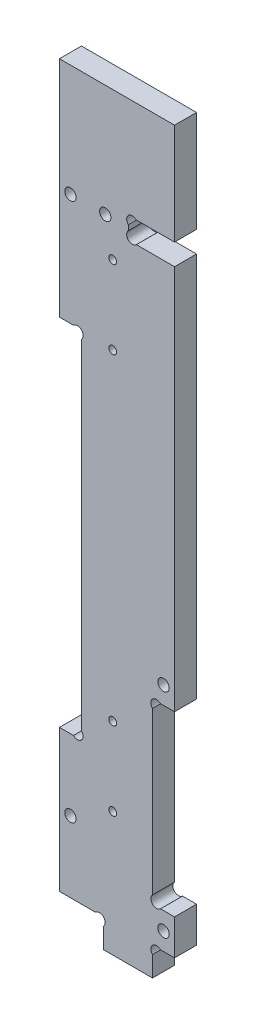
ISO-10303-21;
HEADER;
FILE_DESCRIPTION(('STEP AP214'),'2;1');
FILE_NAME('part.step','',(''),(''),'','','');
FILE_SCHEMA(('AUTOMOTIVE_DESIGN { 1 0 10303 214 1 1 1 1 }'));
ENDSEC;
DATA;
#1=APPLICATION_CONTEXT('core data for automotive mechanical design processes');
#2=APPLICATION_PROTOCOL_DEFINITION('international standard','automotive_design',2000,#1);
#3=PRODUCT_CONTEXT('',#1,'mechanical');
#4=PRODUCT('Part','Part','',(#3));
#5=PRODUCT_RELATED_PRODUCT_CATEGORY('part','',(#4));
#6=PRODUCT_DEFINITION_FORMATION('','',#4);
#7=PRODUCT_DEFINITION_CONTEXT('part definition',#1,'design');
#8=PRODUCT_DEFINITION('design','',#6,#7);
#9=PRODUCT_DEFINITION_SHAPE('','',#8);
#10=(LENGTH_UNIT() NAMED_UNIT(*) SI_UNIT(.MILLI.,.METRE.));
#11=(NAMED_UNIT(*) PLANE_ANGLE_UNIT() SI_UNIT($,.RADIAN.));
#12=(NAMED_UNIT(*) SI_UNIT($,.STERADIAN.) SOLID_ANGLE_UNIT());
#13=UNCERTAINTY_MEASURE_WITH_UNIT(LENGTH_MEASURE(1.E-05),#10,'distance_accuracy_value','');
#14=(GEOMETRIC_REPRESENTATION_CONTEXT(3) GLOBAL_UNCERTAINTY_ASSIGNED_CONTEXT((#13)) GLOBAL_UNIT_ASSIGNED_CONTEXT((#10,
#11,#12)) REPRESENTATION_CONTEXT('',''));
#15=CARTESIAN_POINT('',(0.,0.,0.));
#16=DIRECTION('',(0.,0.,1.));
#17=DIRECTION('',(1.,0.,0.));
#18=AXIS2_PLACEMENT_3D('',#15,#16,#17);
#19=CARTESIAN_POINT('',(5.06862915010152,51.1313708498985,6.2));
#20=DIRECTION('',(0.,0.,1.));
#21=DIRECTION('',(1.,0.,0.));
#22=AXIS2_PLACEMENT_3D('',#19,#20,#21);
#23=PLANE('',#22);
#24=CARTESIAN_POINT('',(15.,171.5,6.2));
#25=DIRECTION('',(0.,0.,1.));
#26=DIRECTION('',(1.,0.,0.));
#27=AXIS2_PLACEMENT_3D('',#24,#25,#26);
#28=CIRCLE('',#27,1.09999999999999);
#29=CARTESIAN_POINT('',(13.9,171.5,6.2));
#30=VERTEX_POINT('',#29);
#31=EDGE_CURVE('E508',#30,#30,#28,.T.);
#32=ORIENTED_EDGE('',*,*,#31,.F.);
#33=EDGE_LOOP('',(#32));
#34=FACE_BOUND('',#33,.T.);
#35=CARTESIAN_POINT('',(15.,59.,6.2));
#36=DIRECTION('',(0.,0.,1.));
#37=DIRECTION('',(1.,0.,0.));
#38=AXIS2_PLACEMENT_3D('',#35,#36,#37);
#39=CIRCLE('',#38,1.09999999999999);
#40=CARTESIAN_POINT('',(13.9,59.,6.2));
#41=VERTEX_POINT('',#40);
#42=EDGE_CURVE('E520',#41,#41,#39,.T.);
#43=ORIENTED_EDGE('',*,*,#42,.F.);
#44=EDGE_LOOP('',(#43));
#45=FACE_BOUND('',#44,.T.);
#46=CARTESIAN_POINT('',(29.3,15.,6.2));
#47=DIRECTION('',(0.,0.,1.));
#48=DIRECTION('',(-1.,0.,0.));
#49=AXIS2_PLACEMENT_3D('',#46,#47,#48);
#50=CIRCLE('',#49,1.6);
#51=CARTESIAN_POINT('',(27.7,15.,6.2));
#52=VERTEX_POINT('',#51);
#53=EDGE_CURVE('E532',#52,#52,#50,.T.);
#54=ORIENTED_EDGE('',*,*,#53,.F.);
#55=EDGE_LOOP('',(#54));
#56=FACE_BOUND('',#55,.T.);
#57=CARTESIAN_POINT('',(3.1,181.5,6.2));
#58=DIRECTION('',(0.,0.,1.));
#59=DIRECTION('',(1.,0.,0.));
#60=AXIS2_PLACEMENT_3D('',#57,#58,#59);
#61=CIRCLE('',#60,1.6);
#62=CARTESIAN_POINT('',(1.5,181.5,6.2));
#63=VERTEX_POINT('',#62);
#64=EDGE_CURVE('E544',#63,#63,#61,.T.);
#65=ORIENTED_EDGE('',*,*,#64,.F.);
#66=EDGE_LOOP('',(#65));
#67=FACE_BOUND('',#66,.T.);
#68=CARTESIAN_POINT('',(5.06862915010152,51.1313708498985,6.2));
#69=DIRECTION('',(0.,0.,-1.));
#70=DIRECTION('',(1.,0.,0.));
#71=AXIS2_PLACEMENT_3D('',#68,#69,#70);
#72=CIRCLE('',#71,1.6);
#73=CARTESIAN_POINT('',(6.2,52.2627416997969,6.2));
#74=VERTEX_POINT('',#73);
#75=CARTESIAN_POINT('',(3.93725830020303,50.,6.2));
#76=VERTEX_POINT('',#75);
#77=EDGE_CURVE('E289',#74,#76,#72,.T.);
#78=ORIENTED_EDGE('',*,*,#77,.T.);
#79=DIRECTION('',(-1.,0.,0.));
#80=VECTOR('',#79,1.);
#81=CARTESIAN_POINT('',(3.93725830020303,50.,6.2));
#82=LINE('',#81,#80);
#83=CARTESIAN_POINT('',(0.,50.,6.2));
#84=VERTEX_POINT('',#83);
#85=EDGE_CURVE('E137',#76,#84,#82,.T.);
#86=ORIENTED_EDGE('',*,*,#85,.T.);
#87=DIRECTION('',(0.,-1.,0.));
#88=VECTOR('',#87,1.);
#89=CARTESIAN_POINT('',(0.,50.,6.2));
#90=LINE('',#89,#88);
#91=CARTESIAN_POINT('',(0.,10.,6.2));
#92=VERTEX_POINT('',#91);
#93=EDGE_CURVE('E364',#84,#92,#90,.T.);
#94=ORIENTED_EDGE('',*,*,#93,.T.);
#95=DIRECTION('',(1.,0.,0.));
#96=VECTOR('',#95,1.);
#97=CARTESIAN_POINT('',(0.,10.,6.2));
#98=LINE('',#97,#96);
#99=CARTESIAN_POINT('',(10.1372583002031,10.,6.2));
#100=VERTEX_POINT('',#99);
#101=EDGE_CURVE('E383',#92,#100,#98,.T.);
#102=ORIENTED_EDGE('',*,*,#101,.T.);
#103=CARTESIAN_POINT('',(11.2686291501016,8.86862915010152,6.2));
#104=DIRECTION('',(0.,0.,-1.));
#105=DIRECTION('',(-1.,0.,0.));
#106=AXIS2_PLACEMENT_3D('',#103,#104,#105);
#107=CIRCLE('',#106,1.6);
#108=CARTESIAN_POINT('',(12.4,7.73725830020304,6.2));
#109=VERTEX_POINT('',#108);
#110=EDGE_CURVE('E380',#100,#109,#107,.T.);
#111=ORIENTED_EDGE('',*,*,#110,.T.);
#112=DIRECTION('',(0.,-1.,0.));
#113=VECTOR('',#112,1.);
#114=CARTESIAN_POINT('',(12.4,7.73725830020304,6.2));
#115=LINE('',#114,#113);
#116=CARTESIAN_POINT('',(12.4,2.,6.2));
#117=VERTEX_POINT('',#116);
#118=EDGE_CURVE('E382',#109,#117,#115,.T.);
#119=ORIENTED_EDGE('',*,*,#118,.T.);
#120=DIRECTION('',(1.,0.,0.));
#121=VECTOR('',#120,1.);
#122=CARTESIAN_POINT('',(12.4,2.,6.2));
#123=LINE('',#122,#121);
#124=CARTESIAN_POINT('',(26.2,2.,6.2));
#125=VERTEX_POINT('',#124);
#126=EDGE_CURVE('E385',#117,#125,#123,.T.);
#127=ORIENTED_EDGE('',*,*,#126,.T.);
#128=DIRECTION('',(0.,1.,0.));
#129=VECTOR('',#128,1.);
#130=CARTESIAN_POINT('',(26.2,7.73725830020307,6.2));
#131=LINE('',#130,#129);
#132=CARTESIAN_POINT('',(26.2,7.73725830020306,6.2));
#133=VERTEX_POINT('',#132);
#134=EDGE_CURVE('E391',#125,#133,#131,.T.);
#135=ORIENTED_EDGE('',*,*,#134,.T.);
#136=CARTESIAN_POINT('',(27.3313708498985,8.86862915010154,6.2));
#137=DIRECTION('',(0.,0.,-1.));
#138=DIRECTION('',(1.,0.,0.));
#139=AXIS2_PLACEMENT_3D('',#136,#137,#138);
#140=CIRCLE('',#139,1.59999999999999);
#141=CARTESIAN_POINT('',(28.462741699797,10.,6.2));
#142=VERTEX_POINT('',#141);
#143=EDGE_CURVE('E393',#133,#142,#140,.T.);
#144=ORIENTED_EDGE('',*,*,#143,.T.);
#145=DIRECTION('',(1.,0.,0.));
#146=VECTOR('',#145,1.);
#147=CARTESIAN_POINT('',(28.462741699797,10.,6.2));
#148=LINE('',#147,#146);
#149=CARTESIAN_POINT('',(32.4,10.,6.2));
#150=VERTEX_POINT('',#149);
#151=EDGE_CURVE('E395',#142,#150,#148,.T.);
#152=ORIENTED_EDGE('',*,*,#151,.T.);
#153=DIRECTION('',(0.,1.,0.));
#154=VECTOR('',#153,1.);
#155=CARTESIAN_POINT('',(32.4,10.,6.2));
#156=LINE('',#155,#154);
#157=CARTESIAN_POINT('',(32.4,20.,6.2));
#158=VERTEX_POINT('',#157);
#159=EDGE_CURVE('E397',#150,#158,#156,.T.);
#160=ORIENTED_EDGE('',*,*,#159,.T.);
#161=DIRECTION('',(-1.,0.,0.));
#162=VECTOR('',#161,1.);
#163=CARTESIAN_POINT('',(32.4,20.,6.2));
#164=LINE('',#163,#162);
#165=CARTESIAN_POINT('',(28.462741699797,20.,6.2));
#166=VERTEX_POINT('',#165);
#167=EDGE_CURVE('E399',#158,#166,#164,.T.);
#168=ORIENTED_EDGE('',*,*,#167,.T.);
#169=CARTESIAN_POINT('',(27.3313708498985,21.1313708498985,6.2));
#170=DIRECTION('',(0.,0.,-1.));
#171=DIRECTION('',(1.,0.,0.));
#172=AXIS2_PLACEMENT_3D('',#169,#170,#171);
#173=CIRCLE('',#172,1.6);
#174=CARTESIAN_POINT('',(26.2,22.262741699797,6.2));
#175=VERTEX_POINT('',#174);
#176=EDGE_CURVE('E401',#166,#175,#173,.T.);
#177=ORIENTED_EDGE('',*,*,#176,.T.);
#178=DIRECTION('',(0.,1.,0.));
#179=VECTOR('',#178,1.);
#180=CARTESIAN_POINT('',(26.2,22.262741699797,6.2));
#181=LINE('',#180,#179);
#182=CARTESIAN_POINT('',(26.2,67.737258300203,6.2));
#183=VERTEX_POINT('',#182);
#184=EDGE_CURVE('E403',#175,#183,#181,.T.);
#185=ORIENTED_EDGE('',*,*,#184,.T.);
#186=CARTESIAN_POINT('',(27.3313708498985,68.8686291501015,6.2));
#187=DIRECTION('',(0.,0.,-1.));
#188=DIRECTION('',(-1.,0.,0.));
#189=AXIS2_PLACEMENT_3D('',#186,#187,#188);
#190=CIRCLE('',#189,1.6);
#191=CARTESIAN_POINT('',(28.462741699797,70.,6.2));
#192=VERTEX_POINT('',#191);
#193=EDGE_CURVE('E405',#183,#192,#190,.T.);
#194=ORIENTED_EDGE('',*,*,#193,.T.);
#195=DIRECTION('',(1.,0.,0.));
#196=VECTOR('',#195,1.);
#197=CARTESIAN_POINT('',(28.462741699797,70.,6.2));
#198=LINE('',#197,#196);
#199=CARTESIAN_POINT('',(32.4,70.,6.2));
#200=VERTEX_POINT('',#199);
#201=EDGE_CURVE('E407',#192,#200,#198,.T.);
#202=ORIENTED_EDGE('',*,*,#201,.T.);
#203=DIRECTION('',(0.,1.,0.));
#204=VECTOR('',#203,1.);
#205=CARTESIAN_POINT('',(32.4,70.,6.2));
#206=LINE('',#205,#204);
#207=CARTESIAN_POINT('',(32.4,178.5,6.2));
#208=VERTEX_POINT('',#207);
#209=EDGE_CURVE('E409',#200,#208,#206,.T.);
#210=ORIENTED_EDGE('',*,*,#209,.T.);
#211=DIRECTION('',(-1.,0.,0.));
#212=VECTOR('',#211,1.);
#213=CARTESIAN_POINT('',(21.662741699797,178.5,6.2));
#214=LINE('',#213,#212);
#215=CARTESIAN_POINT('',(21.662741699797,178.5,6.2));
#216=VERTEX_POINT('',#215);
#217=EDGE_CURVE('E411',#208,#216,#214,.T.);
#218=ORIENTED_EDGE('',*,*,#217,.T.);
#219=CARTESIAN_POINT('',(20.5313708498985,179.631370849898,6.2));
#220=DIRECTION('',(0.,0.,-1.));
#221=DIRECTION('',(-1.,0.,0.));
#222=AXIS2_PLACEMENT_3D('',#219,#220,#221);
#223=CIRCLE('',#222,1.6);
#224=CARTESIAN_POINT('',(19.4,180.762741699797,6.2));
#225=VERTEX_POINT('',#224);
#226=EDGE_CURVE('E413',#216,#225,#223,.T.);
#227=ORIENTED_EDGE('',*,*,#226,.T.);
#228=DIRECTION('',(0.,1.,0.));
#229=VECTOR('',#228,1.);
#230=CARTESIAN_POINT('',(19.4,182.237258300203,6.2));
#231=LINE('',#230,#229);
#232=CARTESIAN_POINT('',(19.4,182.237258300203,6.2));
#233=VERTEX_POINT('',#232);
#234=EDGE_CURVE('E415',#225,#233,#231,.T.);
#235=ORIENTED_EDGE('',*,*,#234,.T.);
#236=CARTESIAN_POINT('',(20.5313708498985,183.368629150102,6.2));
#237=DIRECTION('',(0.,0.,-1.));
#238=DIRECTION('',(1.,0.,0.));
#239=AXIS2_PLACEMENT_3D('',#236,#237,#238);
#240=CIRCLE('',#239,1.60000000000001);
#241=CARTESIAN_POINT('',(21.662741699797,184.5,6.2));
#242=VERTEX_POINT('',#241);
#243=EDGE_CURVE('E417',#233,#242,#240,.T.);
#244=ORIENTED_EDGE('',*,*,#243,.T.);
#245=DIRECTION('',(1.,0.,0.));
#246=VECTOR('',#245,1.);
#247=CARTESIAN_POINT('',(21.662741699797,184.5,6.2));
#248=LINE('',#247,#246);
#249=CARTESIAN_POINT('',(32.4,184.5,6.2));
#250=VERTEX_POINT('',#249);
#251=EDGE_CURVE('E419',#242,#250,#248,.T.);
#252=ORIENTED_EDGE('',*,*,#251,.T.);
#253=DIRECTION('',(0.,1.,0.));
#254=VECTOR('',#253,1.);
#255=CARTESIAN_POINT('',(32.4,184.5,6.2));
#256=LINE('',#255,#254);
#257=CARTESIAN_POINT('',(32.4,213.,6.2));
#258=VERTEX_POINT('',#257);
#259=EDGE_CURVE('E421',#250,#258,#256,.T.);
#260=ORIENTED_EDGE('',*,*,#259,.T.);
#261=DIRECTION('',(-1.,0.,0.));
#262=VECTOR('',#261,1.);
#263=CARTESIAN_POINT('',(0.,213.,6.2));
#264=LINE('',#263,#262);
#265=CARTESIAN_POINT('',(0.,213.,6.2));
#266=VERTEX_POINT('',#265);
#267=EDGE_CURVE('E423',#258,#266,#264,.T.);
#268=ORIENTED_EDGE('',*,*,#267,.T.);
#269=DIRECTION('',(0.,-1.,0.));
#270=VECTOR('',#269,1.);
#271=CARTESIAN_POINT('',(0.,150.,6.2));
#272=LINE('',#271,#270);
#273=CARTESIAN_POINT('',(0.,150.,6.2));
#274=VERTEX_POINT('',#273);
#275=EDGE_CURVE('E216',#266,#274,#272,.T.);
#276=ORIENTED_EDGE('',*,*,#275,.T.);
#277=DIRECTION('',(1.,0.,0.));
#278=VECTOR('',#277,1.);
#279=CARTESIAN_POINT('',(3.93725830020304,150.,6.2));
#280=LINE('',#279,#278);
#281=CARTESIAN_POINT('',(3.93725830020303,150.,6.2));
#282=VERTEX_POINT('',#281);
#283=EDGE_CURVE('E210',#274,#282,#280,.T.);
#284=ORIENTED_EDGE('',*,*,#283,.T.);
#285=CARTESIAN_POINT('',(5.06862915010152,148.868629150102,6.2));
#286=DIRECTION('',(0.,0.,-1.));
#287=DIRECTION('',(-1.,0.,0.));
#288=AXIS2_PLACEMENT_3D('',#285,#286,#287);
#289=CIRCLE('',#288,1.59999999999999);
#290=CARTESIAN_POINT('',(6.2,147.737258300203,6.2));
#291=VERTEX_POINT('',#290);
#292=EDGE_CURVE('E214',#282,#291,#289,.T.);
#293=ORIENTED_EDGE('',*,*,#292,.T.);
#294=DIRECTION('',(0.,-1.,0.));
#295=VECTOR('',#294,1.);
#296=CARTESIAN_POINT('',(6.2,147.737258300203,6.2));
#297=LINE('',#296,#295);
#298=EDGE_CURVE('E34',#291,#74,#297,.T.);
#299=ORIENTED_EDGE('',*,*,#298,.T.);
#300=EDGE_LOOP('',(#78,#86,#94,#102,#111,#119,#127,#135,#144,#152,#160,#168,#177,#185,#194,#202,
#210,#218,#227,#235,#244,#252,#260,#268,#276,#284,#293,#299));
#301=FACE_BOUND('',#300,.T.);
#302=CARTESIAN_POINT('',(3.1,30.,6.2));
#303=DIRECTION('',(0.,0.,1.));
#304=DIRECTION('',(1.,0.,0.));
#305=AXIS2_PLACEMENT_3D('',#302,#303,#304);
#306=CIRCLE('',#305,1.6);
#307=CARTESIAN_POINT('',(1.5,30.,6.2));
#308=VERTEX_POINT('',#307);
#309=EDGE_CURVE('E238',#308,#308,#306,.T.);
#310=ORIENTED_EDGE('',*,*,#309,.F.);
#311=EDGE_LOOP('',(#310));
#312=FACE_BOUND('',#311,.T.);
#313=CARTESIAN_POINT('',(29.3,75.,6.2));
#314=DIRECTION('',(0.,0.,1.));
#315=DIRECTION('',(1.,0.,0.));
#316=AXIS2_PLACEMENT_3D('',#313,#314,#315);
#317=CIRCLE('',#316,1.6);
#318=CARTESIAN_POINT('',(27.7,75.,6.2));
#319=VERTEX_POINT('',#318);
#320=EDGE_CURVE('E538',#319,#319,#317,.T.);
#321=ORIENTED_EDGE('',*,*,#320,.F.);
#322=EDGE_LOOP('',(#321));
#323=FACE_BOUND('',#322,.T.);
#324=CARTESIAN_POINT('',(15.,37.,6.2));
#325=DIRECTION('',(0.,0.,1.));
#326=DIRECTION('',(1.,0.,0.));
#327=AXIS2_PLACEMENT_3D('',#324,#325,#326);
#328=CIRCLE('',#327,1.09999999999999);
#329=CARTESIAN_POINT('',(13.9,37.,6.2));
#330=VERTEX_POINT('',#329);
#331=EDGE_CURVE('E526',#330,#330,#328,.T.);
#332=ORIENTED_EDGE('',*,*,#331,.F.);
#333=EDGE_LOOP('',(#332));
#334=FACE_BOUND('',#333,.T.);
#335=CARTESIAN_POINT('',(15.,149.5,6.2));
#336=DIRECTION('',(0.,0.,1.));
#337=DIRECTION('',(1.,0.,0.));
#338=AXIS2_PLACEMENT_3D('',#335,#336,#337);
#339=CIRCLE('',#338,1.09999999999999);
#340=CARTESIAN_POINT('',(13.9,149.5,6.2));
#341=VERTEX_POINT('',#340);
#342=EDGE_CURVE('E514',#341,#341,#339,.T.);
#343=ORIENTED_EDGE('',*,*,#342,.F.);
#344=EDGE_LOOP('',(#343));
#345=FACE_BOUND('',#344,.T.);
#346=CARTESIAN_POINT('',(12.9,181.5,6.2));
#347=DIRECTION('',(0.,0.,1.));
#348=DIRECTION('',(1.,0.,0.));
#349=AXIS2_PLACEMENT_3D('',#346,#347,#348);
#350=CIRCLE('',#349,1.6);
#351=CARTESIAN_POINT('',(11.3,181.5,6.2));
#352=VERTEX_POINT('',#351);
#353=EDGE_CURVE('E499',#352,#352,#350,.T.);
#354=ORIENTED_EDGE('',*,*,#353,.F.);
#355=EDGE_LOOP('',(#354));
#356=FACE_BOUND('',#355,.T.);
#357=ADVANCED_FACE('F17',(#34,#45,#56,#67,#301,#312,#323,#334,#345,#356),#23,.T.);
#358=CARTESIAN_POINT('',(5.06862915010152,51.1313708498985,0.));
#359=DIRECTION('',(0.,0.,1.));
#360=DIRECTION('',(1.,0.,0.));
#361=AXIS2_PLACEMENT_3D('',#358,#359,#360);
#362=PLANE('',#361);
#363=CARTESIAN_POINT('',(15.,171.5,0.));
#364=DIRECTION('',(0.,0.,1.));
#365=DIRECTION('',(1.,0.,0.));
#366=AXIS2_PLACEMENT_3D('',#363,#364,#365);
#367=CIRCLE('',#366,1.09999999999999);
#368=CARTESIAN_POINT('',(13.9,171.5,0.));
#369=VERTEX_POINT('',#368);
#370=EDGE_CURVE('E505',#369,#369,#367,.T.);
#371=ORIENTED_EDGE('',*,*,#370,.T.);
#372=EDGE_LOOP('',(#371));
#373=FACE_BOUND('',#372,.T.);
#374=CARTESIAN_POINT('',(15.,59.,0.));
#375=DIRECTION('',(0.,0.,1.));
#376=DIRECTION('',(1.,0.,0.));
#377=AXIS2_PLACEMENT_3D('',#374,#375,#376);
#378=CIRCLE('',#377,1.09999999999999);
#379=CARTESIAN_POINT('',(13.9,59.,0.));
#380=VERTEX_POINT('',#379);
#381=EDGE_CURVE('E517',#380,#380,#378,.T.);
#382=ORIENTED_EDGE('',*,*,#381,.T.);
#383=EDGE_LOOP('',(#382));
#384=FACE_BOUND('',#383,.T.);
#385=CARTESIAN_POINT('',(29.3,15.,0.));
#386=DIRECTION('',(0.,0.,1.));
#387=DIRECTION('',(-1.,0.,0.));
#388=AXIS2_PLACEMENT_3D('',#385,#386,#387);
#389=CIRCLE('',#388,1.6);
#390=CARTESIAN_POINT('',(27.7,15.,0.));
#391=VERTEX_POINT('',#390);
#392=EDGE_CURVE('E529',#391,#391,#389,.T.);
#393=ORIENTED_EDGE('',*,*,#392,.T.);
#394=EDGE_LOOP('',(#393));
#395=FACE_BOUND('',#394,.T.);
#396=CARTESIAN_POINT('',(3.1,181.5,0.));
#397=DIRECTION('',(0.,0.,1.));
#398=DIRECTION('',(1.,0.,0.));
#399=AXIS2_PLACEMENT_3D('',#396,#397,#398);
#400=CIRCLE('',#399,1.6);
#401=CARTESIAN_POINT('',(1.5,181.5,0.));
#402=VERTEX_POINT('',#401);
#403=EDGE_CURVE('E541',#402,#402,#400,.T.);
#404=ORIENTED_EDGE('',*,*,#403,.T.);
#405=EDGE_LOOP('',(#404));
#406=FACE_BOUND('',#405,.T.);
#407=CARTESIAN_POINT('',(5.06862915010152,51.1313708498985,0.));
#408=DIRECTION('',(0.,0.,-1.));
#409=DIRECTION('',(1.,0.,0.));
#410=AXIS2_PLACEMENT_3D('',#407,#408,#409);
#411=CIRCLE('',#410,1.6);
#412=CARTESIAN_POINT('',(6.2,52.2627416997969,0.));
#413=VERTEX_POINT('',#412);
#414=CARTESIAN_POINT('',(3.93725830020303,50.,0.));
#415=VERTEX_POINT('',#414);
#416=EDGE_CURVE('E234',#413,#415,#411,.T.);
#417=ORIENTED_EDGE('',*,*,#416,.F.);
#418=DIRECTION('',(0.,-1.,0.));
#419=VECTOR('',#418,1.);
#420=CARTESIAN_POINT('',(6.2,147.737258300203,0.));
#421=LINE('',#420,#419);
#422=CARTESIAN_POINT('',(6.2,147.737258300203,0.));
#423=VERTEX_POINT('',#422);
#424=EDGE_CURVE('E129',#423,#413,#421,.T.);
#425=ORIENTED_EDGE('',*,*,#424,.F.);
#426=CARTESIAN_POINT('',(5.06862915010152,148.868629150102,0.));
#427=DIRECTION('',(0.,0.,-1.));
#428=DIRECTION('',(-1.,0.,0.));
#429=AXIS2_PLACEMENT_3D('',#426,#427,#428);
#430=CIRCLE('',#429,1.59999999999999);
#431=CARTESIAN_POINT('',(3.93725830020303,150.,0.));
#432=VERTEX_POINT('',#431);
#433=EDGE_CURVE('E123',#432,#423,#430,.T.);
#434=ORIENTED_EDGE('',*,*,#433,.F.);
#435=DIRECTION('',(1.,0.,0.));
#436=VECTOR('',#435,1.);
#437=CARTESIAN_POINT('',(3.93725830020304,150.,0.));
#438=LINE('',#437,#436);
#439=CARTESIAN_POINT('',(0.,150.,0.));
#440=VERTEX_POINT('',#439);
#441=EDGE_CURVE('E224',#440,#432,#438,.T.);
#442=ORIENTED_EDGE('',*,*,#441,.F.);
#443=DIRECTION('',(0.,-1.,0.));
#444=VECTOR('',#443,1.);
#445=CARTESIAN_POINT('',(0.,150.,0.));
#446=LINE('',#445,#444);
#447=CARTESIAN_POINT('',(0.,213.,0.));
#448=VERTEX_POINT('',#447);
#449=EDGE_CURVE('E284',#448,#440,#446,.T.);
#450=ORIENTED_EDGE('',*,*,#449,.F.);
#451=DIRECTION('',(-1.,0.,0.));
#452=VECTOR('',#451,1.);
#453=CARTESIAN_POINT('',(0.,213.,0.));
#454=LINE('',#453,#452);
#455=CARTESIAN_POINT('',(32.4,213.,0.));
#456=VERTEX_POINT('',#455);
#457=EDGE_CURVE('E282',#456,#448,#454,.T.);
#458=ORIENTED_EDGE('',*,*,#457,.F.);
#459=DIRECTION('',(0.,1.,0.));
#460=VECTOR('',#459,1.);
#461=CARTESIAN_POINT('',(32.4,184.5,0.));
#462=LINE('',#461,#460);
#463=CARTESIAN_POINT('',(32.4,184.5,0.));
#464=VERTEX_POINT('',#463);
#465=EDGE_CURVE('E280',#464,#456,#462,.T.);
#466=ORIENTED_EDGE('',*,*,#465,.F.);
#467=DIRECTION('',(1.,0.,0.));
#468=VECTOR('',#467,1.);
#469=CARTESIAN_POINT('',(21.662741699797,184.5,0.));
#470=LINE('',#469,#468);
#471=CARTESIAN_POINT('',(21.662741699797,184.5,0.));
#472=VERTEX_POINT('',#471);
#473=EDGE_CURVE('E278',#472,#464,#470,.T.);
#474=ORIENTED_EDGE('',*,*,#473,.F.);
#475=CARTESIAN_POINT('',(20.5313708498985,183.368629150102,0.));
#476=DIRECTION('',(0.,0.,-1.));
#477=DIRECTION('',(1.,0.,0.));
#478=AXIS2_PLACEMENT_3D('',#475,#476,#477);
#479=CIRCLE('',#478,1.60000000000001);
#480=CARTESIAN_POINT('',(19.4,182.237258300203,0.));
#481=VERTEX_POINT('',#480);
#482=EDGE_CURVE('E276',#481,#472,#479,.T.);
#483=ORIENTED_EDGE('',*,*,#482,.F.);
#484=DIRECTION('',(0.,1.,0.));
#485=VECTOR('',#484,1.);
#486=CARTESIAN_POINT('',(19.4,182.237258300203,0.));
#487=LINE('',#486,#485);
#488=CARTESIAN_POINT('',(19.4,180.762741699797,0.));
#489=VERTEX_POINT('',#488);
#490=EDGE_CURVE('E274',#489,#481,#487,.T.);
#491=ORIENTED_EDGE('',*,*,#490,.F.);
#492=CARTESIAN_POINT('',(20.5313708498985,179.631370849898,0.));
#493=DIRECTION('',(0.,0.,-1.));
#494=DIRECTION('',(-1.,0.,0.));
#495=AXIS2_PLACEMENT_3D('',#492,#493,#494);
#496=CIRCLE('',#495,1.6);
#497=CARTESIAN_POINT('',(21.662741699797,178.5,0.));
#498=VERTEX_POINT('',#497);
#499=EDGE_CURVE('E272',#498,#489,#496,.T.);
#500=ORIENTED_EDGE('',*,*,#499,.F.);
#501=DIRECTION('',(-1.,0.,0.));
#502=VECTOR('',#501,1.);
#503=CARTESIAN_POINT('',(21.662741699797,178.5,0.));
#504=LINE('',#503,#502);
#505=CARTESIAN_POINT('',(32.4,178.5,0.));
#506=VERTEX_POINT('',#505);
#507=EDGE_CURVE('E270',#506,#498,#504,.T.);
#508=ORIENTED_EDGE('',*,*,#507,.F.);
#509=DIRECTION('',(0.,1.,0.));
#510=VECTOR('',#509,1.);
#511=CARTESIAN_POINT('',(32.4,70.,0.));
#512=LINE('',#511,#510);
#513=CARTESIAN_POINT('',(32.4,70.,0.));
#514=VERTEX_POINT('',#513);
#515=EDGE_CURVE('E268',#514,#506,#512,.T.);
#516=ORIENTED_EDGE('',*,*,#515,.F.);
#517=DIRECTION('',(1.,0.,0.));
#518=VECTOR('',#517,1.);
#519=CARTESIAN_POINT('',(28.462741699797,70.,0.));
#520=LINE('',#519,#518);
#521=CARTESIAN_POINT('',(28.462741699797,70.,0.));
#522=VERTEX_POINT('',#521);
#523=EDGE_CURVE('E266',#522,#514,#520,.T.);
#524=ORIENTED_EDGE('',*,*,#523,.F.);
#525=CARTESIAN_POINT('',(27.3313708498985,68.8686291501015,0.));
#526=DIRECTION('',(0.,0.,-1.));
#527=DIRECTION('',(-1.,0.,0.));
#528=AXIS2_PLACEMENT_3D('',#525,#526,#527);
#529=CIRCLE('',#528,1.6);
#530=CARTESIAN_POINT('',(26.2,67.737258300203,0.));
#531=VERTEX_POINT('',#530);
#532=EDGE_CURVE('E264',#531,#522,#529,.T.);
#533=ORIENTED_EDGE('',*,*,#532,.F.);
#534=DIRECTION('',(0.,1.,0.));
#535=VECTOR('',#534,1.);
#536=CARTESIAN_POINT('',(26.2,22.262741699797,0.));
#537=LINE('',#536,#535);
#538=CARTESIAN_POINT('',(26.2,22.262741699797,0.));
#539=VERTEX_POINT('',#538);
#540=EDGE_CURVE('E262',#539,#531,#537,.T.);
#541=ORIENTED_EDGE('',*,*,#540,.F.);
#542=CARTESIAN_POINT('',(27.3313708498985,21.1313708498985,0.));
#543=DIRECTION('',(0.,0.,-1.));
#544=DIRECTION('',(1.,0.,0.));
#545=AXIS2_PLACEMENT_3D('',#542,#543,#544);
#546=CIRCLE('',#545,1.6);
#547=CARTESIAN_POINT('',(28.462741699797,20.,0.));
#548=VERTEX_POINT('',#547);
#549=EDGE_CURVE('E260',#548,#539,#546,.T.);
#550=ORIENTED_EDGE('',*,*,#549,.F.);
#551=DIRECTION('',(-1.,0.,0.));
#552=VECTOR('',#551,1.);
#553=CARTESIAN_POINT('',(32.4,20.,0.));
#554=LINE('',#553,#552);
#555=CARTESIAN_POINT('',(32.4,20.,0.));
#556=VERTEX_POINT('',#555);
#557=EDGE_CURVE('E258',#556,#548,#554,.T.);
#558=ORIENTED_EDGE('',*,*,#557,.F.);
#559=DIRECTION('',(0.,1.,0.));
#560=VECTOR('',#559,1.);
#561=CARTESIAN_POINT('',(32.4,10.,0.));
#562=LINE('',#561,#560);
#563=CARTESIAN_POINT('',(32.4,10.,0.));
#564=VERTEX_POINT('',#563);
#565=EDGE_CURVE('E256',#564,#556,#562,.T.);
#566=ORIENTED_EDGE('',*,*,#565,.F.);
#567=DIRECTION('',(1.,0.,0.));
#568=VECTOR('',#567,1.);
#569=CARTESIAN_POINT('',(28.462741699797,10.,0.));
#570=LINE('',#569,#568);
#571=CARTESIAN_POINT('',(28.462741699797,10.,0.));
#572=VERTEX_POINT('',#571);
#573=EDGE_CURVE('E254',#572,#564,#570,.T.);
#574=ORIENTED_EDGE('',*,*,#573,.F.);
#575=CARTESIAN_POINT('',(27.3313708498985,8.86862915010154,0.));
#576=DIRECTION('',(0.,0.,-1.));
#577=DIRECTION('',(1.,0.,0.));
#578=AXIS2_PLACEMENT_3D('',#575,#576,#577);
#579=CIRCLE('',#578,1.59999999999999);
#580=CARTESIAN_POINT('',(26.2,7.73725830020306,0.));
#581=VERTEX_POINT('',#580);
#582=EDGE_CURVE('E252',#581,#572,#579,.T.);
#583=ORIENTED_EDGE('',*,*,#582,.F.);
#584=DIRECTION('',(0.,1.,0.));
#585=VECTOR('',#584,1.);
#586=CARTESIAN_POINT('',(26.2,7.73725830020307,0.));
#587=LINE('',#586,#585);
#588=CARTESIAN_POINT('',(26.2,2.,0.));
#589=VERTEX_POINT('',#588);
#590=EDGE_CURVE('E250',#589,#581,#587,.T.);
#591=ORIENTED_EDGE('',*,*,#590,.F.);
#592=DIRECTION('',(1.,0.,0.));
#593=VECTOR('',#592,1.);
#594=CARTESIAN_POINT('',(12.4,2.,0.));
#595=LINE('',#594,#593);
#596=CARTESIAN_POINT('',(12.4,2.,0.));
#597=VERTEX_POINT('',#596);
#598=EDGE_CURVE('E248',#597,#589,#595,.T.);
#599=ORIENTED_EDGE('',*,*,#598,.F.);
#600=DIRECTION('',(0.,-1.,0.));
#601=VECTOR('',#600,1.);
#602=CARTESIAN_POINT('',(12.4,7.73725830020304,0.));
#603=LINE('',#602,#601);
#604=CARTESIAN_POINT('',(12.4,7.73725830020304,0.));
#605=VERTEX_POINT('',#604);
#606=EDGE_CURVE('E246',#605,#597,#603,.T.);
#607=ORIENTED_EDGE('',*,*,#606,.F.);
#608=CARTESIAN_POINT('',(11.2686291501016,8.86862915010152,0.));
#609=DIRECTION('',(0.,0.,-1.));
#610=DIRECTION('',(-1.,0.,0.));
#611=AXIS2_PLACEMENT_3D('',#608,#609,#610);
#612=CIRCLE('',#611,1.6);
#613=CARTESIAN_POINT('',(10.1372583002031,10.,0.));
#614=VERTEX_POINT('',#613);
#615=EDGE_CURVE('E244',#614,#605,#612,.T.);
#616=ORIENTED_EDGE('',*,*,#615,.F.);
#617=DIRECTION('',(1.,0.,0.));
#618=VECTOR('',#617,1.);
#619=CARTESIAN_POINT('',(0.,10.,0.));
#620=LINE('',#619,#618);
#621=CARTESIAN_POINT('',(0.,10.,0.));
#622=VERTEX_POINT('',#621);
#623=EDGE_CURVE('E242',#622,#614,#620,.T.);
#624=ORIENTED_EDGE('',*,*,#623,.F.);
#625=DIRECTION('',(0.,-1.,0.));
#626=VECTOR('',#625,1.);
#627=CARTESIAN_POINT('',(0.,50.,0.));
#628=LINE('',#627,#626);
#629=CARTESIAN_POINT('',(0.,50.,0.));
#630=VERTEX_POINT('',#629);
#631=EDGE_CURVE('E240',#630,#622,#628,.T.);
#632=ORIENTED_EDGE('',*,*,#631,.F.);
#633=DIRECTION('',(-1.,0.,0.));
#634=VECTOR('',#633,1.);
#635=CARTESIAN_POINT('',(3.93725830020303,50.,0.));
#636=LINE('',#635,#634);
#637=EDGE_CURVE('E237',#415,#630,#636,.T.);
#638=ORIENTED_EDGE('',*,*,#637,.F.);
#639=EDGE_LOOP('',(#417,#425,#434,#442,#450,#458,#466,#474,#483,#491,#500,#508,#516,#524,#533,
#541,#550,#558,#566,#574,#583,#591,#599,#607,#616,#624,#632,#638));
#640=FACE_BOUND('',#639,.T.);
#641=CARTESIAN_POINT('',(3.1,30.,0.));
#642=DIRECTION('',(0.,0.,1.));
#643=DIRECTION('',(1.,0.,0.));
#644=AXIS2_PLACEMENT_3D('',#641,#642,#643);
#645=CIRCLE('',#644,1.6);
#646=CARTESIAN_POINT('',(1.5,30.,0.));
#647=VERTEX_POINT('',#646);
#648=EDGE_CURVE('E547',#647,#647,#645,.T.);
#649=ORIENTED_EDGE('',*,*,#648,.T.);
#650=EDGE_LOOP('',(#649));
#651=FACE_BOUND('',#650,.T.);
#652=CARTESIAN_POINT('',(29.3,75.,0.));
#653=DIRECTION('',(0.,0.,1.));
#654=DIRECTION('',(1.,0.,0.));
#655=AXIS2_PLACEMENT_3D('',#652,#653,#654);
#656=CIRCLE('',#655,1.6);
#657=CARTESIAN_POINT('',(27.7,75.,0.));
#658=VERTEX_POINT('',#657);
#659=EDGE_CURVE('E535',#658,#658,#656,.T.);
#660=ORIENTED_EDGE('',*,*,#659,.T.);
#661=EDGE_LOOP('',(#660));
#662=FACE_BOUND('',#661,.T.);
#663=CARTESIAN_POINT('',(15.,37.,0.));
#664=DIRECTION('',(0.,0.,1.));
#665=DIRECTION('',(1.,0.,0.));
#666=AXIS2_PLACEMENT_3D('',#663,#664,#665);
#667=CIRCLE('',#666,1.09999999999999);
#668=CARTESIAN_POINT('',(13.9,37.,0.));
#669=VERTEX_POINT('',#668);
#670=EDGE_CURVE('E523',#669,#669,#667,.T.);
#671=ORIENTED_EDGE('',*,*,#670,.T.);
#672=EDGE_LOOP('',(#671));
#673=FACE_BOUND('',#672,.T.);
#674=CARTESIAN_POINT('',(15.,149.5,0.));
#675=DIRECTION('',(0.,0.,1.));
#676=DIRECTION('',(1.,0.,0.));
#677=AXIS2_PLACEMENT_3D('',#674,#675,#676);
#678=CIRCLE('',#677,1.09999999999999);
#679=CARTESIAN_POINT('',(13.9,149.5,0.));
#680=VERTEX_POINT('',#679);
#681=EDGE_CURVE('E511',#680,#680,#678,.T.);
#682=ORIENTED_EDGE('',*,*,#681,.T.);
#683=EDGE_LOOP('',(#682));
#684=FACE_BOUND('',#683,.T.);
#685=CARTESIAN_POINT('',(12.9,181.5,0.));
#686=DIRECTION('',(0.,0.,1.));
#687=DIRECTION('',(1.,0.,0.));
#688=AXIS2_PLACEMENT_3D('',#685,#686,#687);
#689=CIRCLE('',#688,1.6);
#690=CARTESIAN_POINT('',(11.3,181.5,0.));
#691=VERTEX_POINT('',#690);
#692=EDGE_CURVE('E502',#691,#691,#689,.T.);
#693=ORIENTED_EDGE('',*,*,#692,.T.);
#694=EDGE_LOOP('',(#693));
#695=FACE_BOUND('',#694,.T.);
#696=ADVANCED_FACE('F368',(#373,#384,#395,#406,#640,#651,#662,#673,#684,#695),#362,.F.);
#697=CARTESIAN_POINT('',(5.06862915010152,51.1313708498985,6.2));
#698=DIRECTION('',(0.,0.,-1.));
#699=DIRECTION('',(-1.,0.,0.));
#700=AXIS2_PLACEMENT_3D('',#697,#698,#699);
#701=CYLINDRICAL_SURFACE('',#700,1.6);
#702=ORIENTED_EDGE('',*,*,#416,.T.);
#703=DIRECTION('',(0.,0.,-1.));
#704=VECTOR('',#703,1.);
#705=CARTESIAN_POINT('',(3.93725830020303,50.,6.2));
#706=LINE('',#705,#704);
#707=EDGE_CURVE('E11',#76,#415,#706,.T.);
#708=ORIENTED_EDGE('',*,*,#707,.F.);
#709=ORIENTED_EDGE('',*,*,#77,.F.);
#710=DIRECTION('',(0.,0.,-1.));
#711=VECTOR('',#710,1.);
#712=CARTESIAN_POINT('',(6.2,52.2627416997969,6.2));
#713=LINE('',#712,#711);
#714=EDGE_CURVE('E230',#74,#413,#713,.T.);
#715=ORIENTED_EDGE('',*,*,#714,.T.);
#716=EDGE_LOOP('',(#702,#708,#709,#715));
#717=FACE_BOUND('',#716,.T.);
#718=ADVANCED_FACE('F19',(#717),#701,.F.);
#719=CARTESIAN_POINT('',(3.93725830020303,50.,6.2));
#720=DIRECTION('',(0.,-1.,0.));
#721=DIRECTION('',(1.,0.,0.));
#722=AXIS2_PLACEMENT_3D('',#719,#720,#721);
#723=PLANE('',#722);
#724=ORIENTED_EDGE('',*,*,#637,.T.);
#725=DIRECTION('',(0.,0.,-1.));
#726=VECTOR('',#725,1.);
#727=CARTESIAN_POINT('',(0.,50.,6.2));
#728=LINE('',#727,#726);
#729=EDGE_CURVE('E26',#84,#630,#728,.T.);
#730=ORIENTED_EDGE('',*,*,#729,.F.);
#731=ORIENTED_EDGE('',*,*,#85,.F.);
#732=ORIENTED_EDGE('',*,*,#707,.T.);
#733=EDGE_LOOP('',(#724,#730,#731,#732));
#734=FACE_BOUND('',#733,.T.);
#735=ADVANCED_FACE('F873',(#734),#723,.F.);
#736=CARTESIAN_POINT('',(0.,50.,6.2));
#737=DIRECTION('',(1.,0.,0.));
#738=DIRECTION('',(0.,0.,-1.));
#739=AXIS2_PLACEMENT_3D('',#736,#737,#738);
#740=PLANE('',#739);
#741=ORIENTED_EDGE('',*,*,#631,.T.);
#742=DIRECTION('',(0.,0.,-1.));
#743=VECTOR('',#742,1.);
#744=CARTESIAN_POINT('',(0.,10.,6.2));
#745=LINE('',#744,#743);
#746=EDGE_CURVE('E356',#92,#622,#745,.T.);
#747=ORIENTED_EDGE('',*,*,#746,.F.);
#748=ORIENTED_EDGE('',*,*,#93,.F.);
#749=ORIENTED_EDGE('',*,*,#729,.T.);
#750=EDGE_LOOP('',(#741,#747,#748,#749));
#751=FACE_BOUND('',#750,.T.);
#752=ADVANCED_FACE('F362',(#751),#740,.F.);
#753=CARTESIAN_POINT('',(0.,10.,6.2));
#754=DIRECTION('',(0.,1.,0.));
#755=DIRECTION('',(-1.,0.,0.));
#756=AXIS2_PLACEMENT_3D('',#753,#754,#755);
#757=PLANE('',#756);
#758=ORIENTED_EDGE('',*,*,#623,.T.);
#759=DIRECTION('',(0.,0.,-1.));
#760=VECTOR('',#759,1.);
#761=CARTESIAN_POINT('',(10.1372583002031,10.,6.2));
#762=LINE('',#761,#760);
#763=EDGE_CURVE('E353',#100,#614,#762,.T.);
#764=ORIENTED_EDGE('',*,*,#763,.F.);
#765=ORIENTED_EDGE('',*,*,#101,.F.);
#766=ORIENTED_EDGE('',*,*,#746,.T.);
#767=EDGE_LOOP('',(#758,#764,#765,#766));
#768=FACE_BOUND('',#767,.T.);
#769=ADVANCED_FACE('F374',(#768),#757,.F.);
#770=CARTESIAN_POINT('',(11.2686291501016,8.86862915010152,6.2));
#771=DIRECTION('',(0.,0.,-1.));
#772=DIRECTION('',(-1.,0.,0.));
#773=AXIS2_PLACEMENT_3D('',#770,#771,#772);
#774=CYLINDRICAL_SURFACE('',#773,1.6);
#775=ORIENTED_EDGE('',*,*,#615,.T.);
#776=DIRECTION('',(0.,0.,-1.));
#777=VECTOR('',#776,1.);
#778=CARTESIAN_POINT('',(12.4,7.73725830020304,6.2));
#779=LINE('',#778,#777);
#780=EDGE_CURVE('E350',#109,#605,#779,.T.);
#781=ORIENTED_EDGE('',*,*,#780,.F.);
#782=ORIENTED_EDGE('',*,*,#110,.F.);
#783=ORIENTED_EDGE('',*,*,#763,.T.);
#784=EDGE_LOOP('',(#775,#781,#782,#783));
#785=FACE_BOUND('',#784,.T.);
#786=ADVANCED_FACE('F378',(#785),#774,.F.);
#787=CARTESIAN_POINT('',(12.4,7.73725830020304,6.2));
#788=DIRECTION('',(1.,0.,0.));
#789=DIRECTION('',(0.,1.,0.));
#790=AXIS2_PLACEMENT_3D('',#787,#788,#789);
#791=PLANE('',#790);
#792=ORIENTED_EDGE('',*,*,#606,.T.);
#793=DIRECTION('',(0.,0.,-1.));
#794=VECTOR('',#793,1.);
#795=CARTESIAN_POINT('',(12.4,2.,6.2));
#796=LINE('',#795,#794);
#797=EDGE_CURVE('E347',#117,#597,#796,.T.);
#798=ORIENTED_EDGE('',*,*,#797,.F.);
#799=ORIENTED_EDGE('',*,*,#118,.F.);
#800=ORIENTED_EDGE('',*,*,#780,.T.);
#801=EDGE_LOOP('',(#792,#798,#799,#800));
#802=FACE_BOUND('',#801,.T.);
#803=ADVANCED_FACE('F838',(#802),#791,.F.);
#804=CARTESIAN_POINT('',(12.4,2.,6.2));
#805=DIRECTION('',(0.,1.,0.));
#806=DIRECTION('',(0.,0.,1.));
#807=AXIS2_PLACEMENT_3D('',#804,#805,#806);
#808=PLANE('',#807);
#809=ORIENTED_EDGE('',*,*,#598,.T.);
#810=DIRECTION('',(0.,0.,-1.));
#811=VECTOR('',#810,1.);
#812=CARTESIAN_POINT('',(26.2,2.,6.2));
#813=LINE('',#812,#811);
#814=EDGE_CURVE('E344',#125,#589,#813,.T.);
#815=ORIENTED_EDGE('',*,*,#814,.F.);
#816=ORIENTED_EDGE('',*,*,#126,.F.);
#817=ORIENTED_EDGE('',*,*,#797,.T.);
#818=EDGE_LOOP('',(#809,#815,#816,#817));
#819=FACE_BOUND('',#818,.T.);
#820=ADVANCED_FACE('F828',(#819),#808,.F.);
#821=CARTESIAN_POINT('',(26.2,7.73725830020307,6.2));
#822=DIRECTION('',(-1.,0.,0.));
#823=DIRECTION('',(0.,-1.,0.));
#824=AXIS2_PLACEMENT_3D('',#821,#822,#823);
#825=PLANE('',#824);
#826=ORIENTED_EDGE('',*,*,#590,.T.);
#827=DIRECTION('',(0.,0.,-1.));
#828=VECTOR('',#827,1.);
#829=CARTESIAN_POINT('',(26.2,7.73725830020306,6.2));
#830=LINE('',#829,#828);
#831=EDGE_CURVE('E341',#133,#581,#830,.T.);
#832=ORIENTED_EDGE('',*,*,#831,.F.);
#833=ORIENTED_EDGE('',*,*,#134,.F.);
#834=ORIENTED_EDGE('',*,*,#814,.T.);
#835=EDGE_LOOP('',(#826,#832,#833,#834));
#836=FACE_BOUND('',#835,.T.);
#837=ADVANCED_FACE('F818',(#836),#825,.F.);
#838=CARTESIAN_POINT('',(27.3313708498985,8.86862915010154,6.2));
#839=DIRECTION('',(0.,0.,-1.));
#840=DIRECTION('',(-1.,0.,0.));
#841=AXIS2_PLACEMENT_3D('',#838,#839,#840);
#842=CYLINDRICAL_SURFACE('',#841,1.59999999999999);
#843=ORIENTED_EDGE('',*,*,#582,.T.);
#844=DIRECTION('',(0.,0.,-1.));
#845=VECTOR('',#844,1.);
#846=CARTESIAN_POINT('',(28.462741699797,10.,6.2));
#847=LINE('',#846,#845);
#848=EDGE_CURVE('E338',#142,#572,#847,.T.);
#849=ORIENTED_EDGE('',*,*,#848,.F.);
#850=ORIENTED_EDGE('',*,*,#143,.F.);
#851=ORIENTED_EDGE('',*,*,#831,.T.);
#852=EDGE_LOOP('',(#843,#849,#850,#851));
#853=FACE_BOUND('',#852,.T.);
#854=ADVANCED_FACE('F808',(#853),#842,.F.);
#855=CARTESIAN_POINT('',(28.462741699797,10.,6.2));
#856=DIRECTION('',(0.,1.,0.));
#857=DIRECTION('',(-1.,0.,0.));
#858=AXIS2_PLACEMENT_3D('',#855,#856,#857);
#859=PLANE('',#858);
#860=ORIENTED_EDGE('',*,*,#573,.T.);
#861=DIRECTION('',(0.,0.,-1.));
#862=VECTOR('',#861,1.);
#863=CARTESIAN_POINT('',(32.4,10.,6.2));
#864=LINE('',#863,#862);
#865=EDGE_CURVE('E335',#150,#564,#864,.T.);
#866=ORIENTED_EDGE('',*,*,#865,.F.);
#867=ORIENTED_EDGE('',*,*,#151,.F.);
#868=ORIENTED_EDGE('',*,*,#848,.T.);
#869=EDGE_LOOP('',(#860,#866,#867,#868));
#870=FACE_BOUND('',#869,.T.);
#871=ADVANCED_FACE('F798',(#870),#859,.F.);
#872=CARTESIAN_POINT('',(32.4,10.,6.2));
#873=DIRECTION('',(-1.,0.,0.));
#874=DIRECTION('',(0.,0.,1.));
#875=AXIS2_PLACEMENT_3D('',#872,#873,#874);
#876=PLANE('',#875);
#877=ORIENTED_EDGE('',*,*,#565,.T.);
#878=DIRECTION('',(0.,0.,-1.));
#879=VECTOR('',#878,1.);
#880=CARTESIAN_POINT('',(32.4,20.,6.2));
#881=LINE('',#880,#879);
#882=EDGE_CURVE('E332',#158,#556,#881,.T.);
#883=ORIENTED_EDGE('',*,*,#882,.F.);
#884=ORIENTED_EDGE('',*,*,#159,.F.);
#885=ORIENTED_EDGE('',*,*,#865,.T.);
#886=EDGE_LOOP('',(#877,#883,#884,#885));
#887=FACE_BOUND('',#886,.T.);
#888=ADVANCED_FACE('F788',(#887),#876,.F.);
#889=CARTESIAN_POINT('',(32.4,20.,6.2));
#890=DIRECTION('',(0.,-1.,0.));
#891=DIRECTION('',(1.,0.,0.));
#892=AXIS2_PLACEMENT_3D('',#889,#890,#891);
#893=PLANE('',#892);
#894=ORIENTED_EDGE('',*,*,#557,.T.);
#895=DIRECTION('',(0.,0.,-1.));
#896=VECTOR('',#895,1.);
#897=CARTESIAN_POINT('',(28.462741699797,20.,6.2));
#898=LINE('',#897,#896);
#899=EDGE_CURVE('E329',#166,#548,#898,.T.);
#900=ORIENTED_EDGE('',*,*,#899,.F.);
#901=ORIENTED_EDGE('',*,*,#167,.F.);
#902=ORIENTED_EDGE('',*,*,#882,.T.);
#903=EDGE_LOOP('',(#894,#900,#901,#902));
#904=FACE_BOUND('',#903,.T.);
#905=ADVANCED_FACE('F778',(#904),#893,.F.);
#906=CARTESIAN_POINT('',(27.3313708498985,21.1313708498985,6.2));
#907=DIRECTION('',(0.,0.,-1.));
#908=DIRECTION('',(-1.,0.,0.));
#909=AXIS2_PLACEMENT_3D('',#906,#907,#908);
#910=CYLINDRICAL_SURFACE('',#909,1.6);
#911=ORIENTED_EDGE('',*,*,#549,.T.);
#912=DIRECTION('',(0.,0.,-1.));
#913=VECTOR('',#912,1.);
#914=CARTESIAN_POINT('',(26.2,22.262741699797,6.2));
#915=LINE('',#914,#913);
#916=EDGE_CURVE('E326',#175,#539,#915,.T.);
#917=ORIENTED_EDGE('',*,*,#916,.F.);
#918=ORIENTED_EDGE('',*,*,#176,.F.);
#919=ORIENTED_EDGE('',*,*,#899,.T.);
#920=EDGE_LOOP('',(#911,#917,#918,#919));
#921=FACE_BOUND('',#920,.T.);
#922=ADVANCED_FACE('F768',(#921),#910,.F.);
#923=CARTESIAN_POINT('',(26.2,22.262741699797,6.2));
#924=DIRECTION('',(-1.,0.,0.));
#925=DIRECTION('',(0.,0.,1.));
#926=AXIS2_PLACEMENT_3D('',#923,#924,#925);
#927=PLANE('',#926);
#928=ORIENTED_EDGE('',*,*,#540,.T.);
#929=DIRECTION('',(0.,0.,-1.));
#930=VECTOR('',#929,1.);
#931=CARTESIAN_POINT('',(26.2,67.737258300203,6.2));
#932=LINE('',#931,#930);
#933=EDGE_CURVE('E323',#183,#531,#932,.T.);
#934=ORIENTED_EDGE('',*,*,#933,.F.);
#935=ORIENTED_EDGE('',*,*,#184,.F.);
#936=ORIENTED_EDGE('',*,*,#916,.T.);
#937=EDGE_LOOP('',(#928,#934,#935,#936));
#938=FACE_BOUND('',#937,.T.);
#939=ADVANCED_FACE('F758',(#938),#927,.F.);
#940=CARTESIAN_POINT('',(27.3313708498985,68.8686291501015,6.2));
#941=DIRECTION('',(0.,0.,-1.));
#942=DIRECTION('',(-1.,0.,0.));
#943=AXIS2_PLACEMENT_3D('',#940,#941,#942);
#944=CYLINDRICAL_SURFACE('',#943,1.6);
#945=ORIENTED_EDGE('',*,*,#532,.T.);
#946=DIRECTION('',(0.,0.,-1.));
#947=VECTOR('',#946,1.);
#948=CARTESIAN_POINT('',(28.462741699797,70.,6.2));
#949=LINE('',#948,#947);
#950=EDGE_CURVE('E320',#192,#522,#949,.T.);
#951=ORIENTED_EDGE('',*,*,#950,.F.);
#952=ORIENTED_EDGE('',*,*,#193,.F.);
#953=ORIENTED_EDGE('',*,*,#933,.T.);
#954=EDGE_LOOP('',(#945,#951,#952,#953));
#955=FACE_BOUND('',#954,.T.);
#956=ADVANCED_FACE('F748',(#955),#944,.F.);
#957=CARTESIAN_POINT('',(28.462741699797,70.,6.2));
#958=DIRECTION('',(0.,1.,0.));
#959=DIRECTION('',(-1.,0.,0.));
#960=AXIS2_PLACEMENT_3D('',#957,#958,#959);
#961=PLANE('',#960);
#962=ORIENTED_EDGE('',*,*,#523,.T.);
#963=DIRECTION('',(0.,0.,-1.));
#964=VECTOR('',#963,1.);
#965=CARTESIAN_POINT('',(32.4,70.,6.2));
#966=LINE('',#965,#964);
#967=EDGE_CURVE('E317',#200,#514,#966,.T.);
#968=ORIENTED_EDGE('',*,*,#967,.F.);
#969=ORIENTED_EDGE('',*,*,#201,.F.);
#970=ORIENTED_EDGE('',*,*,#950,.T.);
#971=EDGE_LOOP('',(#962,#968,#969,#970));
#972=FACE_BOUND('',#971,.T.);
#973=ADVANCED_FACE('F738',(#972),#961,.F.);
#974=CARTESIAN_POINT('',(32.4,70.,6.2));
#975=DIRECTION('',(-1.,0.,0.));
#976=DIRECTION('',(0.,-1.,0.));
#977=AXIS2_PLACEMENT_3D('',#974,#975,#976);
#978=PLANE('',#977);
#979=ORIENTED_EDGE('',*,*,#515,.T.);
#980=DIRECTION('',(0.,0.,-1.));
#981=VECTOR('',#980,1.);
#982=CARTESIAN_POINT('',(32.4,178.5,6.2));
#983=LINE('',#982,#981);
#984=EDGE_CURVE('E314',#208,#506,#983,.T.);
#985=ORIENTED_EDGE('',*,*,#984,.F.);
#986=ORIENTED_EDGE('',*,*,#209,.F.);
#987=ORIENTED_EDGE('',*,*,#967,.T.);
#988=EDGE_LOOP('',(#979,#985,#986,#987));
#989=FACE_BOUND('',#988,.T.);
#990=ADVANCED_FACE('F728',(#989),#978,.F.);
#991=CARTESIAN_POINT('',(21.662741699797,178.5,6.2));
#992=DIRECTION('',(0.,-1.,0.));
#993=DIRECTION('',(0.,0.,-1.));
#994=AXIS2_PLACEMENT_3D('',#991,#992,#993);
#995=PLANE('',#994);
#996=ORIENTED_EDGE('',*,*,#507,.T.);
#997=DIRECTION('',(0.,0.,-1.));
#998=VECTOR('',#997,1.);
#999=CARTESIAN_POINT('',(21.662741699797,178.5,6.2));
#1000=LINE('',#999,#998);
#1001=EDGE_CURVE('E311',#216,#498,#1000,.T.);
#1002=ORIENTED_EDGE('',*,*,#1001,.F.);
#1003=ORIENTED_EDGE('',*,*,#217,.F.);
#1004=ORIENTED_EDGE('',*,*,#984,.T.);
#1005=EDGE_LOOP('',(#996,#1002,#1003,#1004));
#1006=FACE_BOUND('',#1005,.T.);
#1007=ADVANCED_FACE('F718',(#1006),#995,.F.);
#1008=CARTESIAN_POINT('',(20.5313708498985,179.631370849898,6.2));
#1009=DIRECTION('',(0.,0.,-1.));
#1010=DIRECTION('',(-1.,0.,0.));
#1011=AXIS2_PLACEMENT_3D('',#1008,#1009,#1010);
#1012=CYLINDRICAL_SURFACE('',#1011,1.6);
#1013=ORIENTED_EDGE('',*,*,#499,.T.);
#1014=DIRECTION('',(0.,0.,-1.));
#1015=VECTOR('',#1014,1.);
#1016=CARTESIAN_POINT('',(19.4,180.762741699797,6.2));
#1017=LINE('',#1016,#1015);
#1018=EDGE_CURVE('E308',#225,#489,#1017,.T.);
#1019=ORIENTED_EDGE('',*,*,#1018,.F.);
#1020=ORIENTED_EDGE('',*,*,#226,.F.);
#1021=ORIENTED_EDGE('',*,*,#1001,.T.);
#1022=EDGE_LOOP('',(#1013,#1019,#1020,#1021));
#1023=FACE_BOUND('',#1022,.T.);
#1024=ADVANCED_FACE('F708',(#1023),#1012,.F.);
#1025=CARTESIAN_POINT('',(19.4,182.237258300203,6.2));
#1026=DIRECTION('',(-1.,0.,0.));
#1027=DIRECTION('',(0.,0.,1.));
#1028=AXIS2_PLACEMENT_3D('',#1025,#1026,#1027);
#1029=PLANE('',#1028);
#1030=ORIENTED_EDGE('',*,*,#490,.T.);
#1031=DIRECTION('',(0.,0.,-1.));
#1032=VECTOR('',#1031,1.);
#1033=CARTESIAN_POINT('',(19.4,182.237258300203,6.2));
#1034=LINE('',#1033,#1032);
#1035=EDGE_CURVE('E305',#233,#481,#1034,.T.);
#1036=ORIENTED_EDGE('',*,*,#1035,.F.);
#1037=ORIENTED_EDGE('',*,*,#234,.F.);
#1038=ORIENTED_EDGE('',*,*,#1018,.T.);
#1039=EDGE_LOOP('',(#1030,#1036,#1037,#1038));
#1040=FACE_BOUND('',#1039,.T.);
#1041=ADVANCED_FACE('F698',(#1040),#1029,.F.);
#1042=CARTESIAN_POINT('',(20.5313708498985,183.368629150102,6.2));
#1043=DIRECTION('',(0.,0.,-1.));
#1044=DIRECTION('',(-1.,0.,0.));
#1045=AXIS2_PLACEMENT_3D('',#1042,#1043,#1044);
#1046=CYLINDRICAL_SURFACE('',#1045,1.60000000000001);
#1047=ORIENTED_EDGE('',*,*,#482,.T.);
#1048=DIRECTION('',(0.,0.,-1.));
#1049=VECTOR('',#1048,1.);
#1050=CARTESIAN_POINT('',(21.662741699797,184.5,6.2));
#1051=LINE('',#1050,#1049);
#1052=EDGE_CURVE('E302',#242,#472,#1051,.T.);
#1053=ORIENTED_EDGE('',*,*,#1052,.F.);
#1054=ORIENTED_EDGE('',*,*,#243,.F.);
#1055=ORIENTED_EDGE('',*,*,#1035,.T.);
#1056=EDGE_LOOP('',(#1047,#1053,#1054,#1055));
#1057=FACE_BOUND('',#1056,.T.);
#1058=ADVANCED_FACE('F688',(#1057),#1046,.F.);
#1059=CARTESIAN_POINT('',(21.662741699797,184.5,6.2));
#1060=DIRECTION('',(0.,1.,0.));
#1061=DIRECTION('',(0.,0.,1.));
#1062=AXIS2_PLACEMENT_3D('',#1059,#1060,#1061);
#1063=PLANE('',#1062);
#1064=ORIENTED_EDGE('',*,*,#473,.T.);
#1065=DIRECTION('',(0.,0.,-1.));
#1066=VECTOR('',#1065,1.);
#1067=CARTESIAN_POINT('',(32.4,184.5,6.2));
#1068=LINE('',#1067,#1066);
#1069=EDGE_CURVE('E299',#250,#464,#1068,.T.);
#1070=ORIENTED_EDGE('',*,*,#1069,.F.);
#1071=ORIENTED_EDGE('',*,*,#251,.F.);
#1072=ORIENTED_EDGE('',*,*,#1052,.T.);
#1073=EDGE_LOOP('',(#1064,#1070,#1071,#1072));
#1074=FACE_BOUND('',#1073,.T.);
#1075=ADVANCED_FACE('F678',(#1074),#1063,.F.);
#1076=CARTESIAN_POINT('',(32.4,184.5,6.2));
#1077=DIRECTION('',(-1.,0.,0.));
#1078=DIRECTION('',(0.,0.,1.));
#1079=AXIS2_PLACEMENT_3D('',#1076,#1077,#1078);
#1080=PLANE('',#1079);
#1081=ORIENTED_EDGE('',*,*,#465,.T.);
#1082=DIRECTION('',(0.,0.,-1.));
#1083=VECTOR('',#1082,1.);
#1084=CARTESIAN_POINT('',(32.4,213.,6.2));
#1085=LINE('',#1084,#1083);
#1086=EDGE_CURVE('E296',#258,#456,#1085,.T.);
#1087=ORIENTED_EDGE('',*,*,#1086,.F.);
#1088=ORIENTED_EDGE('',*,*,#259,.F.);
#1089=ORIENTED_EDGE('',*,*,#1069,.T.);
#1090=EDGE_LOOP('',(#1081,#1087,#1088,#1089));
#1091=FACE_BOUND('',#1090,.T.);
#1092=ADVANCED_FACE('F669',(#1091),#1080,.F.);
#1093=CARTESIAN_POINT('',(0.,213.,6.2));
#1094=DIRECTION('',(0.,-1.,0.));
#1095=DIRECTION('',(0.,0.,-1.));
#1096=AXIS2_PLACEMENT_3D('',#1093,#1094,#1095);
#1097=PLANE('',#1096);
#1098=ORIENTED_EDGE('',*,*,#457,.T.);
#1099=DIRECTION('',(0.,0.,-1.));
#1100=VECTOR('',#1099,1.);
#1101=CARTESIAN_POINT('',(0.,213.,6.2));
#1102=LINE('',#1101,#1100);
#1103=EDGE_CURVE('E293',#266,#448,#1102,.T.);
#1104=ORIENTED_EDGE('',*,*,#1103,.F.);
#1105=ORIENTED_EDGE('',*,*,#267,.F.);
#1106=ORIENTED_EDGE('',*,*,#1086,.T.);
#1107=EDGE_LOOP('',(#1098,#1104,#1105,#1106));
#1108=FACE_BOUND('',#1107,.T.);
#1109=ADVANCED_FACE('F429',(#1108),#1097,.F.);
#1110=CARTESIAN_POINT('',(0.,150.,6.2));
#1111=DIRECTION('',(1.,0.,0.));
#1112=DIRECTION('',(0.,0.,-1.));
#1113=AXIS2_PLACEMENT_3D('',#1110,#1111,#1112);
#1114=PLANE('',#1113);
#1115=ORIENTED_EDGE('',*,*,#449,.T.);
#1116=DIRECTION('',(0.,0.,-1.));
#1117=VECTOR('',#1116,1.);
#1118=CARTESIAN_POINT('',(0.,150.,6.2));
#1119=LINE('',#1118,#1117);
#1120=EDGE_CURVE('E225',#274,#440,#1119,.T.);
#1121=ORIENTED_EDGE('',*,*,#1120,.F.);
#1122=ORIENTED_EDGE('',*,*,#275,.F.);
#1123=ORIENTED_EDGE('',*,*,#1103,.T.);
#1124=EDGE_LOOP('',(#1115,#1121,#1122,#1123));
#1125=FACE_BOUND('',#1124,.T.);
#1126=ADVANCED_FACE('F433',(#1125),#1114,.F.);
#1127=CARTESIAN_POINT('',(3.93725830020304,150.,6.2));
#1128=DIRECTION('',(0.,1.,0.));
#1129=DIRECTION('',(0.,0.,1.));
#1130=AXIS2_PLACEMENT_3D('',#1127,#1128,#1129);
#1131=PLANE('',#1130);
#1132=ORIENTED_EDGE('',*,*,#441,.T.);
#1133=DIRECTION('',(0.,0.,-1.));
#1134=VECTOR('',#1133,1.);
#1135=CARTESIAN_POINT('',(3.93725830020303,150.,6.2));
#1136=LINE('',#1135,#1134);
#1137=EDGE_CURVE('E221',#282,#432,#1136,.T.);
#1138=ORIENTED_EDGE('',*,*,#1137,.F.);
#1139=ORIENTED_EDGE('',*,*,#283,.F.);
#1140=ORIENTED_EDGE('',*,*,#1120,.T.);
#1141=EDGE_LOOP('',(#1132,#1138,#1139,#1140));
#1142=FACE_BOUND('',#1141,.T.);
#1143=ADVANCED_FACE('F222',(#1142),#1131,.F.);
#1144=CARTESIAN_POINT('',(5.06862915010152,148.868629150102,6.2));
#1145=DIRECTION('',(0.,0.,-1.));
#1146=DIRECTION('',(-1.,0.,0.));
#1147=AXIS2_PLACEMENT_3D('',#1144,#1145,#1146);
#1148=CYLINDRICAL_SURFACE('',#1147,1.59999999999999);
#1149=ORIENTED_EDGE('',*,*,#433,.T.);
#1150=DIRECTION('',(0.,0.,-1.));
#1151=VECTOR('',#1150,1.);
#1152=CARTESIAN_POINT('',(6.2,147.737258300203,6.2));
#1153=LINE('',#1152,#1151);
#1154=EDGE_CURVE('E226',#291,#423,#1153,.T.);
#1155=ORIENTED_EDGE('',*,*,#1154,.F.);
#1156=ORIENTED_EDGE('',*,*,#292,.F.);
#1157=ORIENTED_EDGE('',*,*,#1137,.T.);
#1158=EDGE_LOOP('',(#1149,#1155,#1156,#1157));
#1159=FACE_BOUND('',#1158,.T.);
#1160=ADVANCED_FACE('F228',(#1159),#1148,.F.);
#1161=CARTESIAN_POINT('',(6.2,147.737258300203,6.2));
#1162=DIRECTION('',(1.,0.,0.));
#1163=DIRECTION('',(0.,1.,0.));
#1164=AXIS2_PLACEMENT_3D('',#1161,#1162,#1163);
#1165=PLANE('',#1164);
#1166=ORIENTED_EDGE('',*,*,#424,.T.);
#1167=ORIENTED_EDGE('',*,*,#714,.F.);
#1168=ORIENTED_EDGE('',*,*,#298,.F.);
#1169=ORIENTED_EDGE('',*,*,#1154,.T.);
#1170=EDGE_LOOP('',(#1166,#1167,#1168,#1169));
#1171=FACE_BOUND('',#1170,.T.);
#1172=ADVANCED_FACE('F437',(#1171),#1165,.F.);
#1173=CARTESIAN_POINT('',(3.1,30.,6.2));
#1174=DIRECTION('',(0.,0.,-1.));
#1175=DIRECTION('',(-1.,0.,0.));
#1176=AXIS2_PLACEMENT_3D('',#1173,#1174,#1175);
#1177=CYLINDRICAL_SURFACE('',#1176,1.6);
#1178=CARTESIAN_POINT('',(1.5,30.,6.2));
#1179=CARTESIAN_POINT('',(1.5,30.,6.13541666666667));
#1180=CARTESIAN_POINT('',(1.5,30.,6.07083333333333));
#1181=CARTESIAN_POINT('',(1.5,30.,5.94166666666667));
#1182=CARTESIAN_POINT('',(1.5,30.,5.87708333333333));
#1183=CARTESIAN_POINT('',(1.5,30.,5.74791666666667));
#1184=CARTESIAN_POINT('',(1.5,30.,5.68333333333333));
#1185=CARTESIAN_POINT('',(1.5,30.,5.55416666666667));
#1186=CARTESIAN_POINT('',(1.5,30.,5.48958333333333));
#1187=CARTESIAN_POINT('',(1.5,30.,5.36041666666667));
#1188=CARTESIAN_POINT('',(1.5,30.,5.29583333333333));
#1189=CARTESIAN_POINT('',(1.5,30.,5.16666666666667));
#1190=CARTESIAN_POINT('',(1.5,30.,5.10208333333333));
#1191=CARTESIAN_POINT('',(1.5,30.,4.97291666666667));
#1192=CARTESIAN_POINT('',(1.5,30.,4.90833333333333));
#1193=CARTESIAN_POINT('',(1.5,30.,4.77916666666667));
#1194=CARTESIAN_POINT('',(1.5,30.,4.71458333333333));
#1195=CARTESIAN_POINT('',(1.5,30.,4.58541666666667));
#1196=CARTESIAN_POINT('',(1.5,30.,4.52083333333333));
#1197=CARTESIAN_POINT('',(1.5,30.,4.39166666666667));
#1198=CARTESIAN_POINT('',(1.5,30.,4.32708333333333));
#1199=CARTESIAN_POINT('',(1.5,30.,4.19791666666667));
#1200=CARTESIAN_POINT('',(1.5,30.,4.13333333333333));
#1201=CARTESIAN_POINT('',(1.5,30.,4.00416666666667));
#1202=CARTESIAN_POINT('',(1.5,30.,3.93958333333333));
#1203=CARTESIAN_POINT('',(1.5,30.,3.81041666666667));
#1204=CARTESIAN_POINT('',(1.5,30.,3.74583333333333));
#1205=CARTESIAN_POINT('',(1.5,30.,3.61666666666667));
#1206=CARTESIAN_POINT('',(1.5,30.,3.55208333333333));
#1207=CARTESIAN_POINT('',(1.5,30.,3.42291666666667));
#1208=CARTESIAN_POINT('',(1.5,30.,3.35833333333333));
#1209=CARTESIAN_POINT('',(1.5,30.,3.22916666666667));
#1210=CARTESIAN_POINT('',(1.5,30.,3.16458333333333));
#1211=CARTESIAN_POINT('',(1.5,30.,3.03541666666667));
#1212=CARTESIAN_POINT('',(1.5,30.,2.97083333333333));
#1213=CARTESIAN_POINT('',(1.5,30.,2.84166666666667));
#1214=CARTESIAN_POINT('',(1.5,30.,2.77708333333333));
#1215=CARTESIAN_POINT('',(1.5,30.,2.64791666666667));
#1216=CARTESIAN_POINT('',(1.5,30.,2.58333333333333));
#1217=CARTESIAN_POINT('',(1.5,30.,2.45416666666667));
#1218=CARTESIAN_POINT('',(1.5,30.,2.38958333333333));
#1219=CARTESIAN_POINT('',(1.5,30.,2.26041666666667));
#1220=CARTESIAN_POINT('',(1.5,30.,2.19583333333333));
#1221=CARTESIAN_POINT('',(1.5,30.,2.06666666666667));
#1222=CARTESIAN_POINT('',(1.5,30.,2.00208333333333));
#1223=CARTESIAN_POINT('',(1.5,30.,1.87291666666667));
#1224=CARTESIAN_POINT('',(1.5,30.,1.80833333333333));
#1225=CARTESIAN_POINT('',(1.5,30.,1.67916666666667));
#1226=CARTESIAN_POINT('',(1.5,30.,1.61458333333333));
#1227=CARTESIAN_POINT('',(1.5,30.,1.48541666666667));
#1228=CARTESIAN_POINT('',(1.5,30.,1.42083333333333));
#1229=CARTESIAN_POINT('',(1.5,30.,1.29166666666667));
#1230=CARTESIAN_POINT('',(1.5,30.,1.22708333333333));
#1231=CARTESIAN_POINT('',(1.5,30.,1.09791666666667));
#1232=CARTESIAN_POINT('',(1.5,30.,1.03333333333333));
#1233=CARTESIAN_POINT('',(1.5,30.,0.904166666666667));
#1234=CARTESIAN_POINT('',(1.5,30.,0.839583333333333));
#1235=CARTESIAN_POINT('',(1.5,30.,0.710416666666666));
#1236=CARTESIAN_POINT('',(1.5,30.,0.645833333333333));
#1237=CARTESIAN_POINT('',(1.5,30.,0.516666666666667));
#1238=CARTESIAN_POINT('',(1.5,30.,0.452083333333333));
#1239=CARTESIAN_POINT('',(1.5,30.,0.322916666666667));
#1240=CARTESIAN_POINT('',(1.5,30.,0.258333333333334));
#1241=CARTESIAN_POINT('',(1.5,30.,0.129166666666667));
#1242=CARTESIAN_POINT('',(1.5,30.,0.0645833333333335));
#1243=CARTESIAN_POINT('',(1.5,30.,0.));
#1244=B_SPLINE_CURVE_WITH_KNOTS('',3,(#1178,#1179,#1180,#1181,#1182,#1183,#1184,#1185,#1186,
#1187,#1188,#1189,#1190,#1191,#1192,#1193,#1194,#1195,#1196,#1197,#1198,#1199,#1200,#1201,#1202,
#1203,#1204,#1205,#1206,#1207,#1208,#1209,#1210,#1211,#1212,#1213,#1214,#1215,#1216,#1217,#1218,
#1219,#1220,#1221,#1222,#1223,#1224,#1225,#1226,#1227,#1228,#1229,#1230,#1231,#1232,#1233,#1234,
#1235,#1236,#1237,#1238,#1239,#1240,#1241,#1242,#1243),.UNSPECIFIED.,.F.,.F.,(4,2,2,2,2,2,2,2,2,
2,2,2,2,2,2,2,2,2,2,2,2,2,2,2,2,2,2,2,2,2,2,2,4),(0.,0.193749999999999,0.3875,0.581249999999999,
0.775,0.968749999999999,1.1625,1.35625,1.55,1.74375,1.9375,2.13125,2.325,2.51875,2.7125,2.90625,
3.1,3.29375,3.4875,3.68125,3.875,4.06875,4.2625,4.45625,4.65,4.84375,5.0375,5.23125,5.425,
5.61875,5.8125,6.00625,6.2),.UNSPECIFIED.);
#1245=EDGE_CURVE('BSEAM439',#308,#647,#1244,.T.);
#1246=ORIENTED_EDGE('',*,*,#309,.T.);
#1247=ORIENTED_EDGE('',*,*,#648,.F.);
#1248=ORIENTED_EDGE('',*,*,#1245,.T.);
#1249=ORIENTED_EDGE('',*,*,#1245,.F.);
#1250=EDGE_LOOP('',(#1246,#1248,#1247,#1249));
#1251=FACE_BOUND('',#1250,.T.);
#1252=ADVANCED_FACE('F439',(#1251),#1177,.F.);
#1253=CARTESIAN_POINT('',(3.1,181.5,6.2));
#1254=DIRECTION('',(0.,0.,-1.));
#1255=DIRECTION('',(-1.,0.,0.));
#1256=AXIS2_PLACEMENT_3D('',#1253,#1254,#1255);
#1257=CYLINDRICAL_SURFACE('',#1256,1.6);
#1258=CARTESIAN_POINT('',(1.5,181.5,6.2));
#1259=CARTESIAN_POINT('',(1.5,181.5,6.13541666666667));
#1260=CARTESIAN_POINT('',(1.5,181.5,6.07083333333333));
#1261=CARTESIAN_POINT('',(1.5,181.5,5.94166666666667));
#1262=CARTESIAN_POINT('',(1.5,181.5,5.87708333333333));
#1263=CARTESIAN_POINT('',(1.5,181.5,5.74791666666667));
#1264=CARTESIAN_POINT('',(1.5,181.5,5.68333333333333));
#1265=CARTESIAN_POINT('',(1.5,181.5,5.55416666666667));
#1266=CARTESIAN_POINT('',(1.5,181.5,5.48958333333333));
#1267=CARTESIAN_POINT('',(1.5,181.5,5.36041666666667));
#1268=CARTESIAN_POINT('',(1.5,181.5,5.29583333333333));
#1269=CARTESIAN_POINT('',(1.5,181.5,5.16666666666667));
#1270=CARTESIAN_POINT('',(1.5,181.5,5.10208333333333));
#1271=CARTESIAN_POINT('',(1.5,181.5,4.97291666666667));
#1272=CARTESIAN_POINT('',(1.5,181.5,4.90833333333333));
#1273=CARTESIAN_POINT('',(1.5,181.5,4.77916666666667));
#1274=CARTESIAN_POINT('',(1.5,181.5,4.71458333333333));
#1275=CARTESIAN_POINT('',(1.5,181.5,4.58541666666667));
#1276=CARTESIAN_POINT('',(1.5,181.5,4.52083333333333));
#1277=CARTESIAN_POINT('',(1.5,181.5,4.39166666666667));
#1278=CARTESIAN_POINT('',(1.5,181.5,4.32708333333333));
#1279=CARTESIAN_POINT('',(1.5,181.5,4.19791666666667));
#1280=CARTESIAN_POINT('',(1.5,181.5,4.13333333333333));
#1281=CARTESIAN_POINT('',(1.5,181.5,4.00416666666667));
#1282=CARTESIAN_POINT('',(1.5,181.5,3.93958333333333));
#1283=CARTESIAN_POINT('',(1.5,181.5,3.81041666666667));
#1284=CARTESIAN_POINT('',(1.5,181.5,3.74583333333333));
#1285=CARTESIAN_POINT('',(1.5,181.5,3.61666666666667));
#1286=CARTESIAN_POINT('',(1.5,181.5,3.55208333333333));
#1287=CARTESIAN_POINT('',(1.5,181.5,3.42291666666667));
#1288=CARTESIAN_POINT('',(1.5,181.5,3.35833333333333));
#1289=CARTESIAN_POINT('',(1.5,181.5,3.22916666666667));
#1290=CARTESIAN_POINT('',(1.5,181.5,3.16458333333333));
#1291=CARTESIAN_POINT('',(1.5,181.5,3.03541666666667));
#1292=CARTESIAN_POINT('',(1.5,181.5,2.97083333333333));
#1293=CARTESIAN_POINT('',(1.5,181.5,2.84166666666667));
#1294=CARTESIAN_POINT('',(1.5,181.5,2.77708333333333));
#1295=CARTESIAN_POINT('',(1.5,181.5,2.64791666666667));
#1296=CARTESIAN_POINT('',(1.5,181.5,2.58333333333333));
#1297=CARTESIAN_POINT('',(1.5,181.5,2.45416666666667));
#1298=CARTESIAN_POINT('',(1.5,181.5,2.38958333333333));
#1299=CARTESIAN_POINT('',(1.5,181.5,2.26041666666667));
#1300=CARTESIAN_POINT('',(1.5,181.5,2.19583333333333));
#1301=CARTESIAN_POINT('',(1.5,181.5,2.06666666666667));
#1302=CARTESIAN_POINT('',(1.5,181.5,2.00208333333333));
#1303=CARTESIAN_POINT('',(1.5,181.5,1.87291666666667));
#1304=CARTESIAN_POINT('',(1.5,181.5,1.80833333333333));
#1305=CARTESIAN_POINT('',(1.5,181.5,1.67916666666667));
#1306=CARTESIAN_POINT('',(1.5,181.5,1.61458333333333));
#1307=CARTESIAN_POINT('',(1.5,181.5,1.48541666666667));
#1308=CARTESIAN_POINT('',(1.5,181.5,1.42083333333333));
#1309=CARTESIAN_POINT('',(1.5,181.5,1.29166666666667));
#1310=CARTESIAN_POINT('',(1.5,181.5,1.22708333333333));
#1311=CARTESIAN_POINT('',(1.5,181.5,1.09791666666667));
#1312=CARTESIAN_POINT('',(1.5,181.5,1.03333333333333));
#1313=CARTESIAN_POINT('',(1.5,181.5,0.904166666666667));
#1314=CARTESIAN_POINT('',(1.5,181.5,0.839583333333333));
#1315=CARTESIAN_POINT('',(1.5,181.5,0.710416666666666));
#1316=CARTESIAN_POINT('',(1.5,181.5,0.645833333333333));
#1317=CARTESIAN_POINT('',(1.5,181.5,0.516666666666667));
#1318=CARTESIAN_POINT('',(1.5,181.5,0.452083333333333));
#1319=CARTESIAN_POINT('',(1.5,181.5,0.322916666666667));
#1320=CARTESIAN_POINT('',(1.5,181.5,0.258333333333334));
#1321=CARTESIAN_POINT('',(1.5,181.5,0.129166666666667));
#1322=CARTESIAN_POINT('',(1.5,181.5,0.0645833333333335));
#1323=CARTESIAN_POINT('',(1.5,181.5,0.));
#1324=B_SPLINE_CURVE_WITH_KNOTS('',3,(#1258,#1259,#1260,#1261,#1262,#1263,#1264,#1265,#1266,
#1267,#1268,#1269,#1270,#1271,#1272,#1273,#1274,#1275,#1276,#1277,#1278,#1279,#1280,#1281,#1282,
#1283,#1284,#1285,#1286,#1287,#1288,#1289,#1290,#1291,#1292,#1293,#1294,#1295,#1296,#1297,#1298,
#1299,#1300,#1301,#1302,#1303,#1304,#1305,#1306,#1307,#1308,#1309,#1310,#1311,#1312,#1313,#1314,
#1315,#1316,#1317,#1318,#1319,#1320,#1321,#1322,#1323),.UNSPECIFIED.,.F.,.F.,(4,2,2,2,2,2,2,2,2,
2,2,2,2,2,2,2,2,2,2,2,2,2,2,2,2,2,2,2,2,2,2,2,4),(0.,0.193749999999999,0.3875,0.581249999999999,
0.775,0.968749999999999,1.1625,1.35625,1.55,1.74375,1.9375,2.13125,2.325,2.51875,2.7125,2.90625,
3.1,3.29375,3.4875,3.68125,3.875,4.06875,4.2625,4.45625,4.65,4.84375,5.0375,5.23125,5.425,
5.61875,5.8125,6.00625,6.2),.UNSPECIFIED.);
#1325=EDGE_CURVE('BSEAM447',#63,#402,#1324,.T.);
#1326=ORIENTED_EDGE('',*,*,#64,.T.);
#1327=ORIENTED_EDGE('',*,*,#403,.F.);
#1328=ORIENTED_EDGE('',*,*,#1325,.T.);
#1329=ORIENTED_EDGE('',*,*,#1325,.F.);
#1330=EDGE_LOOP('',(#1326,#1328,#1327,#1329));
#1331=FACE_BOUND('',#1330,.T.);
#1332=ADVANCED_FACE('F447',(#1331),#1257,.F.);
#1333=CARTESIAN_POINT('',(29.3,75.,6.2));
#1334=DIRECTION('',(0.,0.,-1.));
#1335=DIRECTION('',(-1.,0.,0.));
#1336=AXIS2_PLACEMENT_3D('',#1333,#1334,#1335);
#1337=CYLINDRICAL_SURFACE('',#1336,1.6);
#1338=CARTESIAN_POINT('',(27.7,75.,6.2));
#1339=CARTESIAN_POINT('',(27.7,75.,6.13541666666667));
#1340=CARTESIAN_POINT('',(27.7,75.,6.07083333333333));
#1341=CARTESIAN_POINT('',(27.7,75.,5.94166666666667));
#1342=CARTESIAN_POINT('',(27.7,75.,5.87708333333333));
#1343=CARTESIAN_POINT('',(27.7,75.,5.74791666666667));
#1344=CARTESIAN_POINT('',(27.7,75.,5.68333333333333));
#1345=CARTESIAN_POINT('',(27.7,75.,5.55416666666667));
#1346=CARTESIAN_POINT('',(27.7,75.,5.48958333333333));
#1347=CARTESIAN_POINT('',(27.7,75.,5.36041666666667));
#1348=CARTESIAN_POINT('',(27.7,75.,5.29583333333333));
#1349=CARTESIAN_POINT('',(27.7,75.,5.16666666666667));
#1350=CARTESIAN_POINT('',(27.7,75.,5.10208333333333));
#1351=CARTESIAN_POINT('',(27.7,75.,4.97291666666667));
#1352=CARTESIAN_POINT('',(27.7,75.,4.90833333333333));
#1353=CARTESIAN_POINT('',(27.7,75.,4.77916666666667));
#1354=CARTESIAN_POINT('',(27.7,75.,4.71458333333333));
#1355=CARTESIAN_POINT('',(27.7,75.,4.58541666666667));
#1356=CARTESIAN_POINT('',(27.7,75.,4.52083333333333));
#1357=CARTESIAN_POINT('',(27.7,75.,4.39166666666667));
#1358=CARTESIAN_POINT('',(27.7,75.,4.32708333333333));
#1359=CARTESIAN_POINT('',(27.7,75.,4.19791666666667));
#1360=CARTESIAN_POINT('',(27.7,75.,4.13333333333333));
#1361=CARTESIAN_POINT('',(27.7,75.,4.00416666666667));
#1362=CARTESIAN_POINT('',(27.7,75.,3.93958333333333));
#1363=CARTESIAN_POINT('',(27.7,75.,3.81041666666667));
#1364=CARTESIAN_POINT('',(27.7,75.,3.74583333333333));
#1365=CARTESIAN_POINT('',(27.7,75.,3.61666666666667));
#1366=CARTESIAN_POINT('',(27.7,75.,3.55208333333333));
#1367=CARTESIAN_POINT('',(27.7,75.,3.42291666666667));
#1368=CARTESIAN_POINT('',(27.7,75.,3.35833333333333));
#1369=CARTESIAN_POINT('',(27.7,75.,3.22916666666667));
#1370=CARTESIAN_POINT('',(27.7,75.,3.16458333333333));
#1371=CARTESIAN_POINT('',(27.7,75.,3.03541666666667));
#1372=CARTESIAN_POINT('',(27.7,75.,2.97083333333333));
#1373=CARTESIAN_POINT('',(27.7,75.,2.84166666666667));
#1374=CARTESIAN_POINT('',(27.7,75.,2.77708333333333));
#1375=CARTESIAN_POINT('',(27.7,75.,2.64791666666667));
#1376=CARTESIAN_POINT('',(27.7,75.,2.58333333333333));
#1377=CARTESIAN_POINT('',(27.7,75.,2.45416666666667));
#1378=CARTESIAN_POINT('',(27.7,75.,2.38958333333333));
#1379=CARTESIAN_POINT('',(27.7,75.,2.26041666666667));
#1380=CARTESIAN_POINT('',(27.7,75.,2.19583333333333));
#1381=CARTESIAN_POINT('',(27.7,75.,2.06666666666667));
#1382=CARTESIAN_POINT('',(27.7,75.,2.00208333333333));
#1383=CARTESIAN_POINT('',(27.7,75.,1.87291666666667));
#1384=CARTESIAN_POINT('',(27.7,75.,1.80833333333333));
#1385=CARTESIAN_POINT('',(27.7,75.,1.67916666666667));
#1386=CARTESIAN_POINT('',(27.7,75.,1.61458333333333));
#1387=CARTESIAN_POINT('',(27.7,75.,1.48541666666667));
#1388=CARTESIAN_POINT('',(27.7,75.,1.42083333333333));
#1389=CARTESIAN_POINT('',(27.7,75.,1.29166666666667));
#1390=CARTESIAN_POINT('',(27.7,75.,1.22708333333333));
#1391=CARTESIAN_POINT('',(27.7,75.,1.09791666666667));
#1392=CARTESIAN_POINT('',(27.7,75.,1.03333333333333));
#1393=CARTESIAN_POINT('',(27.7,75.,0.904166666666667));
#1394=CARTESIAN_POINT('',(27.7,75.,0.839583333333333));
#1395=CARTESIAN_POINT('',(27.7,75.,0.710416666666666));
#1396=CARTESIAN_POINT('',(27.7,75.,0.645833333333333));
#1397=CARTESIAN_POINT('',(27.7,75.,0.516666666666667));
#1398=CARTESIAN_POINT('',(27.7,75.,0.452083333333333));
#1399=CARTESIAN_POINT('',(27.7,75.,0.322916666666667));
#1400=CARTESIAN_POINT('',(27.7,75.,0.258333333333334));
#1401=CARTESIAN_POINT('',(27.7,75.,0.129166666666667));
#1402=CARTESIAN_POINT('',(27.7,75.,0.0645833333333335));
#1403=CARTESIAN_POINT('',(27.7,75.,0.));
#1404=B_SPLINE_CURVE_WITH_KNOTS('',3,(#1338,#1339,#1340,#1341,#1342,#1343,#1344,#1345,#1346,
#1347,#1348,#1349,#1350,#1351,#1352,#1353,#1354,#1355,#1356,#1357,#1358,#1359,#1360,#1361,#1362,
#1363,#1364,#1365,#1366,#1367,#1368,#1369,#1370,#1371,#1372,#1373,#1374,#1375,#1376,#1377,#1378,
#1379,#1380,#1381,#1382,#1383,#1384,#1385,#1386,#1387,#1388,#1389,#1390,#1391,#1392,#1393,#1394,
#1395,#1396,#1397,#1398,#1399,#1400,#1401,#1402,#1403),.UNSPECIFIED.,.F.,.F.,(4,2,2,2,2,2,2,2,2,
2,2,2,2,2,2,2,2,2,2,2,2,2,2,2,2,2,2,2,2,2,2,2,4),(0.,0.193749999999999,0.3875,0.581249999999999,
0.775,0.968749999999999,1.1625,1.35625,1.55,1.74375,1.9375,2.13125,2.325,2.51875,2.7125,2.90625,
3.1,3.29375,3.4875,3.68125,3.875,4.06875,4.2625,4.45625,4.65,4.84375,5.0375,5.23125,5.425,
5.61875,5.8125,6.00625,6.2),.UNSPECIFIED.);
#1405=EDGE_CURVE('BSEAM465',#319,#658,#1404,.T.);
#1406=ORIENTED_EDGE('',*,*,#320,.T.);
#1407=ORIENTED_EDGE('',*,*,#659,.F.);
#1408=ORIENTED_EDGE('',*,*,#1405,.T.);
#1409=ORIENTED_EDGE('',*,*,#1405,.F.);
#1410=EDGE_LOOP('',(#1406,#1408,#1407,#1409));
#1411=FACE_BOUND('',#1410,.T.);
#1412=ADVANCED_FACE('F465',(#1411),#1337,.F.);
#1413=CARTESIAN_POINT('',(29.3,15.,6.2));
#1414=DIRECTION('',(0.,0.,-1.));
#1415=DIRECTION('',(-1.,0.,0.));
#1416=AXIS2_PLACEMENT_3D('',#1413,#1414,#1415);
#1417=CYLINDRICAL_SURFACE('',#1416,1.6);
#1418=CARTESIAN_POINT('',(27.7,15.,6.2));
#1419=CARTESIAN_POINT('',(27.7,15.,6.13541666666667));
#1420=CARTESIAN_POINT('',(27.7,15.,6.07083333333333));
#1421=CARTESIAN_POINT('',(27.7,15.,5.94166666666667));
#1422=CARTESIAN_POINT('',(27.7,15.,5.87708333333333));
#1423=CARTESIAN_POINT('',(27.7,15.,5.74791666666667));
#1424=CARTESIAN_POINT('',(27.7,15.,5.68333333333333));
#1425=CARTESIAN_POINT('',(27.7,15.,5.55416666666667));
#1426=CARTESIAN_POINT('',(27.7,15.,5.48958333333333));
#1427=CARTESIAN_POINT('',(27.7,15.,5.36041666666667));
#1428=CARTESIAN_POINT('',(27.7,15.,5.29583333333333));
#1429=CARTESIAN_POINT('',(27.7,15.,5.16666666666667));
#1430=CARTESIAN_POINT('',(27.7,15.,5.10208333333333));
#1431=CARTESIAN_POINT('',(27.7,15.,4.97291666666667));
#1432=CARTESIAN_POINT('',(27.7,15.,4.90833333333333));
#1433=CARTESIAN_POINT('',(27.7,15.,4.77916666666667));
#1434=CARTESIAN_POINT('',(27.7,15.,4.71458333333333));
#1435=CARTESIAN_POINT('',(27.7,15.,4.58541666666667));
#1436=CARTESIAN_POINT('',(27.7,15.,4.52083333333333));
#1437=CARTESIAN_POINT('',(27.7,15.,4.39166666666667));
#1438=CARTESIAN_POINT('',(27.7,15.,4.32708333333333));
#1439=CARTESIAN_POINT('',(27.7,15.,4.19791666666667));
#1440=CARTESIAN_POINT('',(27.7,15.,4.13333333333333));
#1441=CARTESIAN_POINT('',(27.7,15.,4.00416666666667));
#1442=CARTESIAN_POINT('',(27.7,15.,3.93958333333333));
#1443=CARTESIAN_POINT('',(27.7,15.,3.81041666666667));
#1444=CARTESIAN_POINT('',(27.7,15.,3.74583333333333));
#1445=CARTESIAN_POINT('',(27.7,15.,3.61666666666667));
#1446=CARTESIAN_POINT('',(27.7,15.,3.55208333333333));
#1447=CARTESIAN_POINT('',(27.7,15.,3.42291666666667));
#1448=CARTESIAN_POINT('',(27.7,15.,3.35833333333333));
#1449=CARTESIAN_POINT('',(27.7,15.,3.22916666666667));
#1450=CARTESIAN_POINT('',(27.7,15.,3.16458333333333));
#1451=CARTESIAN_POINT('',(27.7,15.,3.03541666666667));
#1452=CARTESIAN_POINT('',(27.7,15.,2.97083333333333));
#1453=CARTESIAN_POINT('',(27.7,15.,2.84166666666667));
#1454=CARTESIAN_POINT('',(27.7,15.,2.77708333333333));
#1455=CARTESIAN_POINT('',(27.7,15.,2.64791666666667));
#1456=CARTESIAN_POINT('',(27.7,15.,2.58333333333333));
#1457=CARTESIAN_POINT('',(27.7,15.,2.45416666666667));
#1458=CARTESIAN_POINT('',(27.7,15.,2.38958333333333));
#1459=CARTESIAN_POINT('',(27.7,15.,2.26041666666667));
#1460=CARTESIAN_POINT('',(27.7,15.,2.19583333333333));
#1461=CARTESIAN_POINT('',(27.7,15.,2.06666666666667));
#1462=CARTESIAN_POINT('',(27.7,15.,2.00208333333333));
#1463=CARTESIAN_POINT('',(27.7,15.,1.87291666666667));
#1464=CARTESIAN_POINT('',(27.7,15.,1.80833333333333));
#1465=CARTESIAN_POINT('',(27.7,15.,1.67916666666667));
#1466=CARTESIAN_POINT('',(27.7,15.,1.61458333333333));
#1467=CARTESIAN_POINT('',(27.7,15.,1.48541666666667));
#1468=CARTESIAN_POINT('',(27.7,15.,1.42083333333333));
#1469=CARTESIAN_POINT('',(27.7,15.,1.29166666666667));
#1470=CARTESIAN_POINT('',(27.7,15.,1.22708333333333));
#1471=CARTESIAN_POINT('',(27.7,15.,1.09791666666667));
#1472=CARTESIAN_POINT('',(27.7,15.,1.03333333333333));
#1473=CARTESIAN_POINT('',(27.7,15.,0.904166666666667));
#1474=CARTESIAN_POINT('',(27.7,15.,0.839583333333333));
#1475=CARTESIAN_POINT('',(27.7,15.,0.710416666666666));
#1476=CARTESIAN_POINT('',(27.7,15.,0.645833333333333));
#1477=CARTESIAN_POINT('',(27.7,15.,0.516666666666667));
#1478=CARTESIAN_POINT('',(27.7,15.,0.452083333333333));
#1479=CARTESIAN_POINT('',(27.7,15.,0.322916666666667));
#1480=CARTESIAN_POINT('',(27.7,15.,0.258333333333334));
#1481=CARTESIAN_POINT('',(27.7,15.,0.129166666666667));
#1482=CARTESIAN_POINT('',(27.7,15.,0.0645833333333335));
#1483=CARTESIAN_POINT('',(27.7,15.,0.));
#1484=B_SPLINE_CURVE_WITH_KNOTS('',3,(#1418,#1419,#1420,#1421,#1422,#1423,#1424,#1425,#1426,
#1427,#1428,#1429,#1430,#1431,#1432,#1433,#1434,#1435,#1436,#1437,#1438,#1439,#1440,#1441,#1442,
#1443,#1444,#1445,#1446,#1447,#1448,#1449,#1450,#1451,#1452,#1453,#1454,#1455,#1456,#1457,#1458,
#1459,#1460,#1461,#1462,#1463,#1464,#1465,#1466,#1467,#1468,#1469,#1470,#1471,#1472,#1473,#1474,
#1475,#1476,#1477,#1478,#1479,#1480,#1481,#1482,#1483),.UNSPECIFIED.,.F.,.F.,(4,2,2,2,2,2,2,2,2,
2,2,2,2,2,2,2,2,2,2,2,2,2,2,2,2,2,2,2,2,2,2,2,4),(0.,0.193749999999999,0.3875,0.581249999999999,
0.775,0.968749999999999,1.1625,1.35625,1.55,1.74375,1.9375,2.13125,2.325,2.51875,2.7125,2.90625,
3.1,3.29375,3.4875,3.68125,3.875,4.06875,4.2625,4.45625,4.65,4.84375,5.0375,5.23125,5.425,
5.61875,5.8125,6.00625,6.2),.UNSPECIFIED.);
#1485=EDGE_CURVE('BSEAM469',#52,#391,#1484,.T.);
#1486=ORIENTED_EDGE('',*,*,#53,.T.);
#1487=ORIENTED_EDGE('',*,*,#392,.F.);
#1488=ORIENTED_EDGE('',*,*,#1485,.T.);
#1489=ORIENTED_EDGE('',*,*,#1485,.F.);
#1490=EDGE_LOOP('',(#1486,#1488,#1487,#1489));
#1491=FACE_BOUND('',#1490,.T.);
#1492=ADVANCED_FACE('F469',(#1491),#1417,.F.);
#1493=CARTESIAN_POINT('',(15.,37.,6.2));
#1494=DIRECTION('',(0.,0.,-1.));
#1495=DIRECTION('',(-1.,0.,0.));
#1496=AXIS2_PLACEMENT_3D('',#1493,#1494,#1495);
#1497=CYLINDRICAL_SURFACE('',#1496,1.09999999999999);
#1498=CARTESIAN_POINT('',(13.9,37.,6.2));
#1499=CARTESIAN_POINT('',(13.9,37.,6.13541666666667));
#1500=CARTESIAN_POINT('',(13.9,37.,6.07083333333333));
#1501=CARTESIAN_POINT('',(13.9,37.,5.94166666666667));
#1502=CARTESIAN_POINT('',(13.9,37.,5.87708333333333));
#1503=CARTESIAN_POINT('',(13.9,37.,5.74791666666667));
#1504=CARTESIAN_POINT('',(13.9,37.,5.68333333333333));
#1505=CARTESIAN_POINT('',(13.9,37.,5.55416666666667));
#1506=CARTESIAN_POINT('',(13.9,37.,5.48958333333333));
#1507=CARTESIAN_POINT('',(13.9,37.,5.36041666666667));
#1508=CARTESIAN_POINT('',(13.9,37.,5.29583333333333));
#1509=CARTESIAN_POINT('',(13.9,37.,5.16666666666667));
#1510=CARTESIAN_POINT('',(13.9,37.,5.10208333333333));
#1511=CARTESIAN_POINT('',(13.9,37.,4.97291666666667));
#1512=CARTESIAN_POINT('',(13.9,37.,4.90833333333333));
#1513=CARTESIAN_POINT('',(13.9,37.,4.77916666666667));
#1514=CARTESIAN_POINT('',(13.9,37.,4.71458333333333));
#1515=CARTESIAN_POINT('',(13.9,37.,4.58541666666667));
#1516=CARTESIAN_POINT('',(13.9,37.,4.52083333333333));
#1517=CARTESIAN_POINT('',(13.9,37.,4.39166666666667));
#1518=CARTESIAN_POINT('',(13.9,37.,4.32708333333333));
#1519=CARTESIAN_POINT('',(13.9,37.,4.19791666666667));
#1520=CARTESIAN_POINT('',(13.9,37.,4.13333333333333));
#1521=CARTESIAN_POINT('',(13.9,37.,4.00416666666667));
#1522=CARTESIAN_POINT('',(13.9,37.,3.93958333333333));
#1523=CARTESIAN_POINT('',(13.9,37.,3.81041666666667));
#1524=CARTESIAN_POINT('',(13.9,37.,3.74583333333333));
#1525=CARTESIAN_POINT('',(13.9,37.,3.61666666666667));
#1526=CARTESIAN_POINT('',(13.9,37.,3.55208333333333));
#1527=CARTESIAN_POINT('',(13.9,37.,3.42291666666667));
#1528=CARTESIAN_POINT('',(13.9,37.,3.35833333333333));
#1529=CARTESIAN_POINT('',(13.9,37.,3.22916666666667));
#1530=CARTESIAN_POINT('',(13.9,37.,3.16458333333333));
#1531=CARTESIAN_POINT('',(13.9,37.,3.03541666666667));
#1532=CARTESIAN_POINT('',(13.9,37.,2.97083333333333));
#1533=CARTESIAN_POINT('',(13.9,37.,2.84166666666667));
#1534=CARTESIAN_POINT('',(13.9,37.,2.77708333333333));
#1535=CARTESIAN_POINT('',(13.9,37.,2.64791666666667));
#1536=CARTESIAN_POINT('',(13.9,37.,2.58333333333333));
#1537=CARTESIAN_POINT('',(13.9,37.,2.45416666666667));
#1538=CARTESIAN_POINT('',(13.9,37.,2.38958333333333));
#1539=CARTESIAN_POINT('',(13.9,37.,2.26041666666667));
#1540=CARTESIAN_POINT('',(13.9,37.,2.19583333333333));
#1541=CARTESIAN_POINT('',(13.9,37.,2.06666666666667));
#1542=CARTESIAN_POINT('',(13.9,37.,2.00208333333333));
#1543=CARTESIAN_POINT('',(13.9,37.,1.87291666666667));
#1544=CARTESIAN_POINT('',(13.9,37.,1.80833333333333));
#1545=CARTESIAN_POINT('',(13.9,37.,1.67916666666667));
#1546=CARTESIAN_POINT('',(13.9,37.,1.61458333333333));
#1547=CARTESIAN_POINT('',(13.9,37.,1.48541666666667));
#1548=CARTESIAN_POINT('',(13.9,37.,1.42083333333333));
#1549=CARTESIAN_POINT('',(13.9,37.,1.29166666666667));
#1550=CARTESIAN_POINT('',(13.9,37.,1.22708333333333));
#1551=CARTESIAN_POINT('',(13.9,37.,1.09791666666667));
#1552=CARTESIAN_POINT('',(13.9,37.,1.03333333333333));
#1553=CARTESIAN_POINT('',(13.9,37.,0.904166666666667));
#1554=CARTESIAN_POINT('',(13.9,37.,0.839583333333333));
#1555=CARTESIAN_POINT('',(13.9,37.,0.710416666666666));
#1556=CARTESIAN_POINT('',(13.9,37.,0.645833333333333));
#1557=CARTESIAN_POINT('',(13.9,37.,0.516666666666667));
#1558=CARTESIAN_POINT('',(13.9,37.,0.452083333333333));
#1559=CARTESIAN_POINT('',(13.9,37.,0.322916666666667));
#1560=CARTESIAN_POINT('',(13.9,37.,0.258333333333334));
#1561=CARTESIAN_POINT('',(13.9,37.,0.129166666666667));
#1562=CARTESIAN_POINT('',(13.9,37.,0.0645833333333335));
#1563=CARTESIAN_POINT('',(13.9,37.,0.));
#1564=B_SPLINE_CURVE_WITH_KNOTS('',3,(#1498,#1499,#1500,#1501,#1502,#1503,#1504,#1505,#1506,
#1507,#1508,#1509,#1510,#1511,#1512,#1513,#1514,#1515,#1516,#1517,#1518,#1519,#1520,#1521,#1522,
#1523,#1524,#1525,#1526,#1527,#1528,#1529,#1530,#1531,#1532,#1533,#1534,#1535,#1536,#1537,#1538,
#1539,#1540,#1541,#1542,#1543,#1544,#1545,#1546,#1547,#1548,#1549,#1550,#1551,#1552,#1553,#1554,
#1555,#1556,#1557,#1558,#1559,#1560,#1561,#1562,#1563),.UNSPECIFIED.,.F.,.F.,(4,2,2,2,2,2,2,2,2,
2,2,2,2,2,2,2,2,2,2,2,2,2,2,2,2,2,2,2,2,2,2,2,4),(0.,0.193749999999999,0.3875,0.581249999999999,
0.775,0.968749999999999,1.1625,1.35625,1.55,1.74375,1.9375,2.13125,2.325,2.51875,2.7125,2.90625,
3.1,3.29375,3.4875,3.68125,3.875,4.06875,4.2625,4.45625,4.65,4.84375,5.0375,5.23125,5.425,
5.61875,5.8125,6.00625,6.2),.UNSPECIFIED.);
#1565=EDGE_CURVE('BSEAM473',#330,#669,#1564,.T.);
#1566=ORIENTED_EDGE('',*,*,#331,.T.);
#1567=ORIENTED_EDGE('',*,*,#670,.F.);
#1568=ORIENTED_EDGE('',*,*,#1565,.T.);
#1569=ORIENTED_EDGE('',*,*,#1565,.F.);
#1570=EDGE_LOOP('',(#1566,#1568,#1567,#1569));
#1571=FACE_BOUND('',#1570,.T.);
#1572=ADVANCED_FACE('F473',(#1571),#1497,.F.);
#1573=CARTESIAN_POINT('',(15.,59.,6.2));
#1574=DIRECTION('',(0.,0.,-1.));
#1575=DIRECTION('',(-1.,0.,0.));
#1576=AXIS2_PLACEMENT_3D('',#1573,#1574,#1575);
#1577=CYLINDRICAL_SURFACE('',#1576,1.09999999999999);
#1578=CARTESIAN_POINT('',(13.9,59.,6.2));
#1579=CARTESIAN_POINT('',(13.9,59.,6.13541666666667));
#1580=CARTESIAN_POINT('',(13.9,59.,6.07083333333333));
#1581=CARTESIAN_POINT('',(13.9,59.,5.94166666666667));
#1582=CARTESIAN_POINT('',(13.9,59.,5.87708333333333));
#1583=CARTESIAN_POINT('',(13.9,59.,5.74791666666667));
#1584=CARTESIAN_POINT('',(13.9,59.,5.68333333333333));
#1585=CARTESIAN_POINT('',(13.9,59.,5.55416666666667));
#1586=CARTESIAN_POINT('',(13.9,59.,5.48958333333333));
#1587=CARTESIAN_POINT('',(13.9,59.,5.36041666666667));
#1588=CARTESIAN_POINT('',(13.9,59.,5.29583333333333));
#1589=CARTESIAN_POINT('',(13.9,59.,5.16666666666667));
#1590=CARTESIAN_POINT('',(13.9,59.,5.10208333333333));
#1591=CARTESIAN_POINT('',(13.9,59.,4.97291666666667));
#1592=CARTESIAN_POINT('',(13.9,59.,4.90833333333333));
#1593=CARTESIAN_POINT('',(13.9,59.,4.77916666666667));
#1594=CARTESIAN_POINT('',(13.9,59.,4.71458333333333));
#1595=CARTESIAN_POINT('',(13.9,59.,4.58541666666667));
#1596=CARTESIAN_POINT('',(13.9,59.,4.52083333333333));
#1597=CARTESIAN_POINT('',(13.9,59.,4.39166666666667));
#1598=CARTESIAN_POINT('',(13.9,59.,4.32708333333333));
#1599=CARTESIAN_POINT('',(13.9,59.,4.19791666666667));
#1600=CARTESIAN_POINT('',(13.9,59.,4.13333333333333));
#1601=CARTESIAN_POINT('',(13.9,59.,4.00416666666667));
#1602=CARTESIAN_POINT('',(13.9,59.,3.93958333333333));
#1603=CARTESIAN_POINT('',(13.9,59.,3.81041666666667));
#1604=CARTESIAN_POINT('',(13.9,59.,3.74583333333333));
#1605=CARTESIAN_POINT('',(13.9,59.,3.61666666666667));
#1606=CARTESIAN_POINT('',(13.9,59.,3.55208333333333));
#1607=CARTESIAN_POINT('',(13.9,59.,3.42291666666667));
#1608=CARTESIAN_POINT('',(13.9,59.,3.35833333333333));
#1609=CARTESIAN_POINT('',(13.9,59.,3.22916666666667));
#1610=CARTESIAN_POINT('',(13.9,59.,3.16458333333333));
#1611=CARTESIAN_POINT('',(13.9,59.,3.03541666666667));
#1612=CARTESIAN_POINT('',(13.9,59.,2.97083333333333));
#1613=CARTESIAN_POINT('',(13.9,59.,2.84166666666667));
#1614=CARTESIAN_POINT('',(13.9,59.,2.77708333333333));
#1615=CARTESIAN_POINT('',(13.9,59.,2.64791666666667));
#1616=CARTESIAN_POINT('',(13.9,59.,2.58333333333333));
#1617=CARTESIAN_POINT('',(13.9,59.,2.45416666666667));
#1618=CARTESIAN_POINT('',(13.9,59.,2.38958333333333));
#1619=CARTESIAN_POINT('',(13.9,59.,2.26041666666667));
#1620=CARTESIAN_POINT('',(13.9,59.,2.19583333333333));
#1621=CARTESIAN_POINT('',(13.9,59.,2.06666666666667));
#1622=CARTESIAN_POINT('',(13.9,59.,2.00208333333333));
#1623=CARTESIAN_POINT('',(13.9,59.,1.87291666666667));
#1624=CARTESIAN_POINT('',(13.9,59.,1.80833333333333));
#1625=CARTESIAN_POINT('',(13.9,59.,1.67916666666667));
#1626=CARTESIAN_POINT('',(13.9,59.,1.61458333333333));
#1627=CARTESIAN_POINT('',(13.9,59.,1.48541666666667));
#1628=CARTESIAN_POINT('',(13.9,59.,1.42083333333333));
#1629=CARTESIAN_POINT('',(13.9,59.,1.29166666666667));
#1630=CARTESIAN_POINT('',(13.9,59.,1.22708333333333));
#1631=CARTESIAN_POINT('',(13.9,59.,1.09791666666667));
#1632=CARTESIAN_POINT('',(13.9,59.,1.03333333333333));
#1633=CARTESIAN_POINT('',(13.9,59.,0.904166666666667));
#1634=CARTESIAN_POINT('',(13.9,59.,0.839583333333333));
#1635=CARTESIAN_POINT('',(13.9,59.,0.710416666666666));
#1636=CARTESIAN_POINT('',(13.9,59.,0.645833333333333));
#1637=CARTESIAN_POINT('',(13.9,59.,0.516666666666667));
#1638=CARTESIAN_POINT('',(13.9,59.,0.452083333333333));
#1639=CARTESIAN_POINT('',(13.9,59.,0.322916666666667));
#1640=CARTESIAN_POINT('',(13.9,59.,0.258333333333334));
#1641=CARTESIAN_POINT('',(13.9,59.,0.129166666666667));
#1642=CARTESIAN_POINT('',(13.9,59.,0.0645833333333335));
#1643=CARTESIAN_POINT('',(13.9,59.,0.));
#1644=B_SPLINE_CURVE_WITH_KNOTS('',3,(#1578,#1579,#1580,#1581,#1582,#1583,#1584,#1585,#1586,
#1587,#1588,#1589,#1590,#1591,#1592,#1593,#1594,#1595,#1596,#1597,#1598,#1599,#1600,#1601,#1602,
#1603,#1604,#1605,#1606,#1607,#1608,#1609,#1610,#1611,#1612,#1613,#1614,#1615,#1616,#1617,#1618,
#1619,#1620,#1621,#1622,#1623,#1624,#1625,#1626,#1627,#1628,#1629,#1630,#1631,#1632,#1633,#1634,
#1635,#1636,#1637,#1638,#1639,#1640,#1641,#1642,#1643),.UNSPECIFIED.,.F.,.F.,(4,2,2,2,2,2,2,2,2,
2,2,2,2,2,2,2,2,2,2,2,2,2,2,2,2,2,2,2,2,2,2,2,4),(0.,0.193749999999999,0.3875,0.581249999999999,
0.775,0.968749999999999,1.1625,1.35625,1.55,1.74375,1.9375,2.13125,2.325,2.51875,2.7125,2.90625,
3.1,3.29375,3.4875,3.68125,3.875,4.06875,4.2625,4.45625,4.65,4.84375,5.0375,5.23125,5.425,
5.61875,5.8125,6.00625,6.2),.UNSPECIFIED.);
#1645=EDGE_CURVE('BSEAM477',#41,#380,#1644,.T.);
#1646=ORIENTED_EDGE('',*,*,#42,.T.);
#1647=ORIENTED_EDGE('',*,*,#381,.F.);
#1648=ORIENTED_EDGE('',*,*,#1645,.T.);
#1649=ORIENTED_EDGE('',*,*,#1645,.F.);
#1650=EDGE_LOOP('',(#1646,#1648,#1647,#1649));
#1651=FACE_BOUND('',#1650,.T.);
#1652=ADVANCED_FACE('F477',(#1651),#1577,.F.);
#1653=CARTESIAN_POINT('',(15.,149.5,6.2));
#1654=DIRECTION('',(0.,0.,-1.));
#1655=DIRECTION('',(-1.,0.,0.));
#1656=AXIS2_PLACEMENT_3D('',#1653,#1654,#1655);
#1657=CYLINDRICAL_SURFACE('',#1656,1.09999999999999);
#1658=CARTESIAN_POINT('',(13.9,149.5,6.2));
#1659=CARTESIAN_POINT('',(13.9,149.5,6.13541666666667));
#1660=CARTESIAN_POINT('',(13.9,149.5,6.07083333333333));
#1661=CARTESIAN_POINT('',(13.9,149.5,5.94166666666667));
#1662=CARTESIAN_POINT('',(13.9,149.5,5.87708333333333));
#1663=CARTESIAN_POINT('',(13.9,149.5,5.74791666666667));
#1664=CARTESIAN_POINT('',(13.9,149.5,5.68333333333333));
#1665=CARTESIAN_POINT('',(13.9,149.5,5.55416666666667));
#1666=CARTESIAN_POINT('',(13.9,149.5,5.48958333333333));
#1667=CARTESIAN_POINT('',(13.9,149.5,5.36041666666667));
#1668=CARTESIAN_POINT('',(13.9,149.5,5.29583333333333));
#1669=CARTESIAN_POINT('',(13.9,149.5,5.16666666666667));
#1670=CARTESIAN_POINT('',(13.9,149.5,5.10208333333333));
#1671=CARTESIAN_POINT('',(13.9,149.5,4.97291666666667));
#1672=CARTESIAN_POINT('',(13.9,149.5,4.90833333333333));
#1673=CARTESIAN_POINT('',(13.9,149.5,4.77916666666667));
#1674=CARTESIAN_POINT('',(13.9,149.5,4.71458333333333));
#1675=CARTESIAN_POINT('',(13.9,149.5,4.58541666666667));
#1676=CARTESIAN_POINT('',(13.9,149.5,4.52083333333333));
#1677=CARTESIAN_POINT('',(13.9,149.5,4.39166666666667));
#1678=CARTESIAN_POINT('',(13.9,149.5,4.32708333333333));
#1679=CARTESIAN_POINT('',(13.9,149.5,4.19791666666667));
#1680=CARTESIAN_POINT('',(13.9,149.5,4.13333333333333));
#1681=CARTESIAN_POINT('',(13.9,149.5,4.00416666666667));
#1682=CARTESIAN_POINT('',(13.9,149.5,3.93958333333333));
#1683=CARTESIAN_POINT('',(13.9,149.5,3.81041666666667));
#1684=CARTESIAN_POINT('',(13.9,149.5,3.74583333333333));
#1685=CARTESIAN_POINT('',(13.9,149.5,3.61666666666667));
#1686=CARTESIAN_POINT('',(13.9,149.5,3.55208333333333));
#1687=CARTESIAN_POINT('',(13.9,149.5,3.42291666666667));
#1688=CARTESIAN_POINT('',(13.9,149.5,3.35833333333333));
#1689=CARTESIAN_POINT('',(13.9,149.5,3.22916666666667));
#1690=CARTESIAN_POINT('',(13.9,149.5,3.16458333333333));
#1691=CARTESIAN_POINT('',(13.9,149.5,3.03541666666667));
#1692=CARTESIAN_POINT('',(13.9,149.5,2.97083333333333));
#1693=CARTESIAN_POINT('',(13.9,149.5,2.84166666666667));
#1694=CARTESIAN_POINT('',(13.9,149.5,2.77708333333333));
#1695=CARTESIAN_POINT('',(13.9,149.5,2.64791666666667));
#1696=CARTESIAN_POINT('',(13.9,149.5,2.58333333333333));
#1697=CARTESIAN_POINT('',(13.9,149.5,2.45416666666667));
#1698=CARTESIAN_POINT('',(13.9,149.5,2.38958333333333));
#1699=CARTESIAN_POINT('',(13.9,149.5,2.26041666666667));
#1700=CARTESIAN_POINT('',(13.9,149.5,2.19583333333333));
#1701=CARTESIAN_POINT('',(13.9,149.5,2.06666666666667));
#1702=CARTESIAN_POINT('',(13.9,149.5,2.00208333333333));
#1703=CARTESIAN_POINT('',(13.9,149.5,1.87291666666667));
#1704=CARTESIAN_POINT('',(13.9,149.5,1.80833333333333));
#1705=CARTESIAN_POINT('',(13.9,149.5,1.67916666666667));
#1706=CARTESIAN_POINT('',(13.9,149.5,1.61458333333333));
#1707=CARTESIAN_POINT('',(13.9,149.5,1.48541666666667));
#1708=CARTESIAN_POINT('',(13.9,149.5,1.42083333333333));
#1709=CARTESIAN_POINT('',(13.9,149.5,1.29166666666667));
#1710=CARTESIAN_POINT('',(13.9,149.5,1.22708333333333));
#1711=CARTESIAN_POINT('',(13.9,149.5,1.09791666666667));
#1712=CARTESIAN_POINT('',(13.9,149.5,1.03333333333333));
#1713=CARTESIAN_POINT('',(13.9,149.5,0.904166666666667));
#1714=CARTESIAN_POINT('',(13.9,149.5,0.839583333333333));
#1715=CARTESIAN_POINT('',(13.9,149.5,0.710416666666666));
#1716=CARTESIAN_POINT('',(13.9,149.5,0.645833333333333));
#1717=CARTESIAN_POINT('',(13.9,149.5,0.516666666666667));
#1718=CARTESIAN_POINT('',(13.9,149.5,0.452083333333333));
#1719=CARTESIAN_POINT('',(13.9,149.5,0.322916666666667));
#1720=CARTESIAN_POINT('',(13.9,149.5,0.258333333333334));
#1721=CARTESIAN_POINT('',(13.9,149.5,0.129166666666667));
#1722=CARTESIAN_POINT('',(13.9,149.5,0.0645833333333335));
#1723=CARTESIAN_POINT('',(13.9,149.5,0.));
#1724=B_SPLINE_CURVE_WITH_KNOTS('',3,(#1658,#1659,#1660,#1661,#1662,#1663,#1664,#1665,#1666,
#1667,#1668,#1669,#1670,#1671,#1672,#1673,#1674,#1675,#1676,#1677,#1678,#1679,#1680,#1681,#1682,
#1683,#1684,#1685,#1686,#1687,#1688,#1689,#1690,#1691,#1692,#1693,#1694,#1695,#1696,#1697,#1698,
#1699,#1700,#1701,#1702,#1703,#1704,#1705,#1706,#1707,#1708,#1709,#1710,#1711,#1712,#1713,#1714,
#1715,#1716,#1717,#1718,#1719,#1720,#1721,#1722,#1723),.UNSPECIFIED.,.F.,.F.,(4,2,2,2,2,2,2,2,2,
2,2,2,2,2,2,2,2,2,2,2,2,2,2,2,2,2,2,2,2,2,2,2,4),(0.,0.193749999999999,0.3875,0.581249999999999,
0.775,0.968749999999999,1.1625,1.35625,1.55,1.74375,1.9375,2.13125,2.325,2.51875,2.7125,2.90625,
3.1,3.29375,3.4875,3.68125,3.875,4.06875,4.2625,4.45625,4.65,4.84375,5.0375,5.23125,5.425,
5.61875,5.8125,6.00625,6.2),.UNSPECIFIED.);
#1725=EDGE_CURVE('BSEAM481',#341,#680,#1724,.T.);
#1726=ORIENTED_EDGE('',*,*,#342,.T.);
#1727=ORIENTED_EDGE('',*,*,#681,.F.);
#1728=ORIENTED_EDGE('',*,*,#1725,.T.);
#1729=ORIENTED_EDGE('',*,*,#1725,.F.);
#1730=EDGE_LOOP('',(#1726,#1728,#1727,#1729));
#1731=FACE_BOUND('',#1730,.T.);
#1732=ADVANCED_FACE('F481',(#1731),#1657,.F.);
#1733=CARTESIAN_POINT('',(15.,171.5,6.2));
#1734=DIRECTION('',(0.,0.,-1.));
#1735=DIRECTION('',(-1.,0.,0.));
#1736=AXIS2_PLACEMENT_3D('',#1733,#1734,#1735);
#1737=CYLINDRICAL_SURFACE('',#1736,1.09999999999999);
#1738=CARTESIAN_POINT('',(13.9,171.5,6.2));
#1739=CARTESIAN_POINT('',(13.9,171.5,6.13541666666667));
#1740=CARTESIAN_POINT('',(13.9,171.5,6.07083333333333));
#1741=CARTESIAN_POINT('',(13.9,171.5,5.94166666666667));
#1742=CARTESIAN_POINT('',(13.9,171.5,5.87708333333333));
#1743=CARTESIAN_POINT('',(13.9,171.5,5.74791666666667));
#1744=CARTESIAN_POINT('',(13.9,171.5,5.68333333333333));
#1745=CARTESIAN_POINT('',(13.9,171.5,5.55416666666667));
#1746=CARTESIAN_POINT('',(13.9,171.5,5.48958333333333));
#1747=CARTESIAN_POINT('',(13.9,171.5,5.36041666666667));
#1748=CARTESIAN_POINT('',(13.9,171.5,5.29583333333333));
#1749=CARTESIAN_POINT('',(13.9,171.5,5.16666666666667));
#1750=CARTESIAN_POINT('',(13.9,171.5,5.10208333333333));
#1751=CARTESIAN_POINT('',(13.9,171.5,4.97291666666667));
#1752=CARTESIAN_POINT('',(13.9,171.5,4.90833333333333));
#1753=CARTESIAN_POINT('',(13.9,171.5,4.77916666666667));
#1754=CARTESIAN_POINT('',(13.9,171.5,4.71458333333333));
#1755=CARTESIAN_POINT('',(13.9,171.5,4.58541666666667));
#1756=CARTESIAN_POINT('',(13.9,171.5,4.52083333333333));
#1757=CARTESIAN_POINT('',(13.9,171.5,4.39166666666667));
#1758=CARTESIAN_POINT('',(13.9,171.5,4.32708333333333));
#1759=CARTESIAN_POINT('',(13.9,171.5,4.19791666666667));
#1760=CARTESIAN_POINT('',(13.9,171.5,4.13333333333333));
#1761=CARTESIAN_POINT('',(13.9,171.5,4.00416666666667));
#1762=CARTESIAN_POINT('',(13.9,171.5,3.93958333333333));
#1763=CARTESIAN_POINT('',(13.9,171.5,3.81041666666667));
#1764=CARTESIAN_POINT('',(13.9,171.5,3.74583333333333));
#1765=CARTESIAN_POINT('',(13.9,171.5,3.61666666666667));
#1766=CARTESIAN_POINT('',(13.9,171.5,3.55208333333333));
#1767=CARTESIAN_POINT('',(13.9,171.5,3.42291666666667));
#1768=CARTESIAN_POINT('',(13.9,171.5,3.35833333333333));
#1769=CARTESIAN_POINT('',(13.9,171.5,3.22916666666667));
#1770=CARTESIAN_POINT('',(13.9,171.5,3.16458333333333));
#1771=CARTESIAN_POINT('',(13.9,171.5,3.03541666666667));
#1772=CARTESIAN_POINT('',(13.9,171.5,2.97083333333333));
#1773=CARTESIAN_POINT('',(13.9,171.5,2.84166666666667));
#1774=CARTESIAN_POINT('',(13.9,171.5,2.77708333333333));
#1775=CARTESIAN_POINT('',(13.9,171.5,2.64791666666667));
#1776=CARTESIAN_POINT('',(13.9,171.5,2.58333333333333));
#1777=CARTESIAN_POINT('',(13.9,171.5,2.45416666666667));
#1778=CARTESIAN_POINT('',(13.9,171.5,2.38958333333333));
#1779=CARTESIAN_POINT('',(13.9,171.5,2.26041666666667));
#1780=CARTESIAN_POINT('',(13.9,171.5,2.19583333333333));
#1781=CARTESIAN_POINT('',(13.9,171.5,2.06666666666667));
#1782=CARTESIAN_POINT('',(13.9,171.5,2.00208333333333));
#1783=CARTESIAN_POINT('',(13.9,171.5,1.87291666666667));
#1784=CARTESIAN_POINT('',(13.9,171.5,1.80833333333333));
#1785=CARTESIAN_POINT('',(13.9,171.5,1.67916666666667));
#1786=CARTESIAN_POINT('',(13.9,171.5,1.61458333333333));
#1787=CARTESIAN_POINT('',(13.9,171.5,1.48541666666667));
#1788=CARTESIAN_POINT('',(13.9,171.5,1.42083333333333));
#1789=CARTESIAN_POINT('',(13.9,171.5,1.29166666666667));
#1790=CARTESIAN_POINT('',(13.9,171.5,1.22708333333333));
#1791=CARTESIAN_POINT('',(13.9,171.5,1.09791666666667));
#1792=CARTESIAN_POINT('',(13.9,171.5,1.03333333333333));
#1793=CARTESIAN_POINT('',(13.9,171.5,0.904166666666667));
#1794=CARTESIAN_POINT('',(13.9,171.5,0.839583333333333));
#1795=CARTESIAN_POINT('',(13.9,171.5,0.710416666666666));
#1796=CARTESIAN_POINT('',(13.9,171.5,0.645833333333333));
#1797=CARTESIAN_POINT('',(13.9,171.5,0.516666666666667));
#1798=CARTESIAN_POINT('',(13.9,171.5,0.452083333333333));
#1799=CARTESIAN_POINT('',(13.9,171.5,0.322916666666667));
#1800=CARTESIAN_POINT('',(13.9,171.5,0.258333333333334));
#1801=CARTESIAN_POINT('',(13.9,171.5,0.129166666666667));
#1802=CARTESIAN_POINT('',(13.9,171.5,0.0645833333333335));
#1803=CARTESIAN_POINT('',(13.9,171.5,0.));
#1804=B_SPLINE_CURVE_WITH_KNOTS('',3,(#1738,#1739,#1740,#1741,#1742,#1743,#1744,#1745,#1746,
#1747,#1748,#1749,#1750,#1751,#1752,#1753,#1754,#1755,#1756,#1757,#1758,#1759,#1760,#1761,#1762,
#1763,#1764,#1765,#1766,#1767,#1768,#1769,#1770,#1771,#1772,#1773,#1774,#1775,#1776,#1777,#1778,
#1779,#1780,#1781,#1782,#1783,#1784,#1785,#1786,#1787,#1788,#1789,#1790,#1791,#1792,#1793,#1794,
#1795,#1796,#1797,#1798,#1799,#1800,#1801,#1802,#1803),.UNSPECIFIED.,.F.,.F.,(4,2,2,2,2,2,2,2,2,
2,2,2,2,2,2,2,2,2,2,2,2,2,2,2,2,2,2,2,2,2,2,2,4),(0.,0.193749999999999,0.3875,0.581249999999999,
0.775,0.968749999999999,1.1625,1.35625,1.55,1.74375,1.9375,2.13125,2.325,2.51875,2.7125,2.90625,
3.1,3.29375,3.4875,3.68125,3.875,4.06875,4.2625,4.45625,4.65,4.84375,5.0375,5.23125,5.425,
5.61875,5.8125,6.00625,6.2),.UNSPECIFIED.);
#1805=EDGE_CURVE('BSEAM485',#30,#369,#1804,.T.);
#1806=ORIENTED_EDGE('',*,*,#31,.T.);
#1807=ORIENTED_EDGE('',*,*,#370,.F.);
#1808=ORIENTED_EDGE('',*,*,#1805,.T.);
#1809=ORIENTED_EDGE('',*,*,#1805,.F.);
#1810=EDGE_LOOP('',(#1806,#1808,#1807,#1809));
#1811=FACE_BOUND('',#1810,.T.);
#1812=ADVANCED_FACE('F485',(#1811),#1737,.F.);
#1813=CARTESIAN_POINT('',(12.9,181.5,6.2));
#1814=DIRECTION('',(0.,0.,-1.));
#1815=DIRECTION('',(-1.,0.,0.));
#1816=AXIS2_PLACEMENT_3D('',#1813,#1814,#1815);
#1817=CYLINDRICAL_SURFACE('',#1816,1.6);
#1818=CARTESIAN_POINT('',(11.3,181.5,6.2));
#1819=CARTESIAN_POINT('',(11.3,181.5,6.13541666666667));
#1820=CARTESIAN_POINT('',(11.3,181.5,6.07083333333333));
#1821=CARTESIAN_POINT('',(11.3,181.5,5.94166666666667));
#1822=CARTESIAN_POINT('',(11.3,181.5,5.87708333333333));
#1823=CARTESIAN_POINT('',(11.3,181.5,5.74791666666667));
#1824=CARTESIAN_POINT('',(11.3,181.5,5.68333333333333));
#1825=CARTESIAN_POINT('',(11.3,181.5,5.55416666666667));
#1826=CARTESIAN_POINT('',(11.3,181.5,5.48958333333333));
#1827=CARTESIAN_POINT('',(11.3,181.5,5.36041666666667));
#1828=CARTESIAN_POINT('',(11.3,181.5,5.29583333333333));
#1829=CARTESIAN_POINT('',(11.3,181.5,5.16666666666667));
#1830=CARTESIAN_POINT('',(11.3,181.5,5.10208333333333));
#1831=CARTESIAN_POINT('',(11.3,181.5,4.97291666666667));
#1832=CARTESIAN_POINT('',(11.3,181.5,4.90833333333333));
#1833=CARTESIAN_POINT('',(11.3,181.5,4.77916666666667));
#1834=CARTESIAN_POINT('',(11.3,181.5,4.71458333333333));
#1835=CARTESIAN_POINT('',(11.3,181.5,4.58541666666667));
#1836=CARTESIAN_POINT('',(11.3,181.5,4.52083333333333));
#1837=CARTESIAN_POINT('',(11.3,181.5,4.39166666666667));
#1838=CARTESIAN_POINT('',(11.3,181.5,4.32708333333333));
#1839=CARTESIAN_POINT('',(11.3,181.5,4.19791666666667));
#1840=CARTESIAN_POINT('',(11.3,181.5,4.13333333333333));
#1841=CARTESIAN_POINT('',(11.3,181.5,4.00416666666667));
#1842=CARTESIAN_POINT('',(11.3,181.5,3.93958333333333));
#1843=CARTESIAN_POINT('',(11.3,181.5,3.81041666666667));
#1844=CARTESIAN_POINT('',(11.3,181.5,3.74583333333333));
#1845=CARTESIAN_POINT('',(11.3,181.5,3.61666666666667));
#1846=CARTESIAN_POINT('',(11.3,181.5,3.55208333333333));
#1847=CARTESIAN_POINT('',(11.3,181.5,3.42291666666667));
#1848=CARTESIAN_POINT('',(11.3,181.5,3.35833333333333));
#1849=CARTESIAN_POINT('',(11.3,181.5,3.22916666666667));
#1850=CARTESIAN_POINT('',(11.3,181.5,3.16458333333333));
#1851=CARTESIAN_POINT('',(11.3,181.5,3.03541666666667));
#1852=CARTESIAN_POINT('',(11.3,181.5,2.97083333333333));
#1853=CARTESIAN_POINT('',(11.3,181.5,2.84166666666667));
#1854=CARTESIAN_POINT('',(11.3,181.5,2.77708333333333));
#1855=CARTESIAN_POINT('',(11.3,181.5,2.64791666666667));
#1856=CARTESIAN_POINT('',(11.3,181.5,2.58333333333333));
#1857=CARTESIAN_POINT('',(11.3,181.5,2.45416666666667));
#1858=CARTESIAN_POINT('',(11.3,181.5,2.38958333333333));
#1859=CARTESIAN_POINT('',(11.3,181.5,2.26041666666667));
#1860=CARTESIAN_POINT('',(11.3,181.5,2.19583333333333));
#1861=CARTESIAN_POINT('',(11.3,181.5,2.06666666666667));
#1862=CARTESIAN_POINT('',(11.3,181.5,2.00208333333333));
#1863=CARTESIAN_POINT('',(11.3,181.5,1.87291666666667));
#1864=CARTESIAN_POINT('',(11.3,181.5,1.80833333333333));
#1865=CARTESIAN_POINT('',(11.3,181.5,1.67916666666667));
#1866=CARTESIAN_POINT('',(11.3,181.5,1.61458333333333));
#1867=CARTESIAN_POINT('',(11.3,181.5,1.48541666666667));
#1868=CARTESIAN_POINT('',(11.3,181.5,1.42083333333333));
#1869=CARTESIAN_POINT('',(11.3,181.5,1.29166666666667));
#1870=CARTESIAN_POINT('',(11.3,181.5,1.22708333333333));
#1871=CARTESIAN_POINT('',(11.3,181.5,1.09791666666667));
#1872=CARTESIAN_POINT('',(11.3,181.5,1.03333333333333));
#1873=CARTESIAN_POINT('',(11.3,181.5,0.904166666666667));
#1874=CARTESIAN_POINT('',(11.3,181.5,0.839583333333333));
#1875=CARTESIAN_POINT('',(11.3,181.5,0.710416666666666));
#1876=CARTESIAN_POINT('',(11.3,181.5,0.645833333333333));
#1877=CARTESIAN_POINT('',(11.3,181.5,0.516666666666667));
#1878=CARTESIAN_POINT('',(11.3,181.5,0.452083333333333));
#1879=CARTESIAN_POINT('',(11.3,181.5,0.322916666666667));
#1880=CARTESIAN_POINT('',(11.3,181.5,0.258333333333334));
#1881=CARTESIAN_POINT('',(11.3,181.5,0.129166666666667));
#1882=CARTESIAN_POINT('',(11.3,181.5,0.0645833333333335));
#1883=CARTESIAN_POINT('',(11.3,181.5,0.));
#1884=B_SPLINE_CURVE_WITH_KNOTS('',3,(#1818,#1819,#1820,#1821,#1822,#1823,#1824,#1825,#1826,
#1827,#1828,#1829,#1830,#1831,#1832,#1833,#1834,#1835,#1836,#1837,#1838,#1839,#1840,#1841,#1842,
#1843,#1844,#1845,#1846,#1847,#1848,#1849,#1850,#1851,#1852,#1853,#1854,#1855,#1856,#1857,#1858,
#1859,#1860,#1861,#1862,#1863,#1864,#1865,#1866,#1867,#1868,#1869,#1870,#1871,#1872,#1873,#1874,
#1875,#1876,#1877,#1878,#1879,#1880,#1881,#1882,#1883),.UNSPECIFIED.,.F.,.F.,(4,2,2,2,2,2,2,2,2,
2,2,2,2,2,2,2,2,2,2,2,2,2,2,2,2,2,2,2,2,2,2,2,4),(0.,0.193749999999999,0.3875,0.581249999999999,
0.775,0.968749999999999,1.1625,1.35625,1.55,1.74375,1.9375,2.13125,2.325,2.51875,2.7125,2.90625,
3.1,3.29375,3.4875,3.68125,3.875,4.06875,4.2625,4.45625,4.65,4.84375,5.0375,5.23125,5.425,
5.61875,5.8125,6.00625,6.2),.UNSPECIFIED.);
#1885=EDGE_CURVE('BSEAM489',#352,#691,#1884,.T.);
#1886=ORIENTED_EDGE('',*,*,#353,.T.);
#1887=ORIENTED_EDGE('',*,*,#692,.F.);
#1888=ORIENTED_EDGE('',*,*,#1885,.T.);
#1889=ORIENTED_EDGE('',*,*,#1885,.F.);
#1890=EDGE_LOOP('',(#1886,#1888,#1887,#1889));
#1891=FACE_BOUND('',#1890,.T.);
#1892=ADVANCED_FACE('F489',(#1891),#1817,.F.);
#1893=CLOSED_SHELL('',(#357,#696,#718,#735,#752,#769,#786,#803,#820,#837,#854,#871,#888,#905,
#922,#939,#956,#973,#990,#1007,#1024,#1041,#1058,#1075,#1092,#1109,#1126,#1143,#1160,#1172,
#1252,#1332,#1412,#1492,#1572,#1652,#1732,#1812,#1892));
#1894=MANIFOLD_SOLID_BREP('B1',#1893);
#1895=ADVANCED_BREP_SHAPE_REPRESENTATION('',(#18,#1894),#14);
#1896=SHAPE_DEFINITION_REPRESENTATION(#9,#1895);
ENDSEC;
END-ISO-10303-21;
